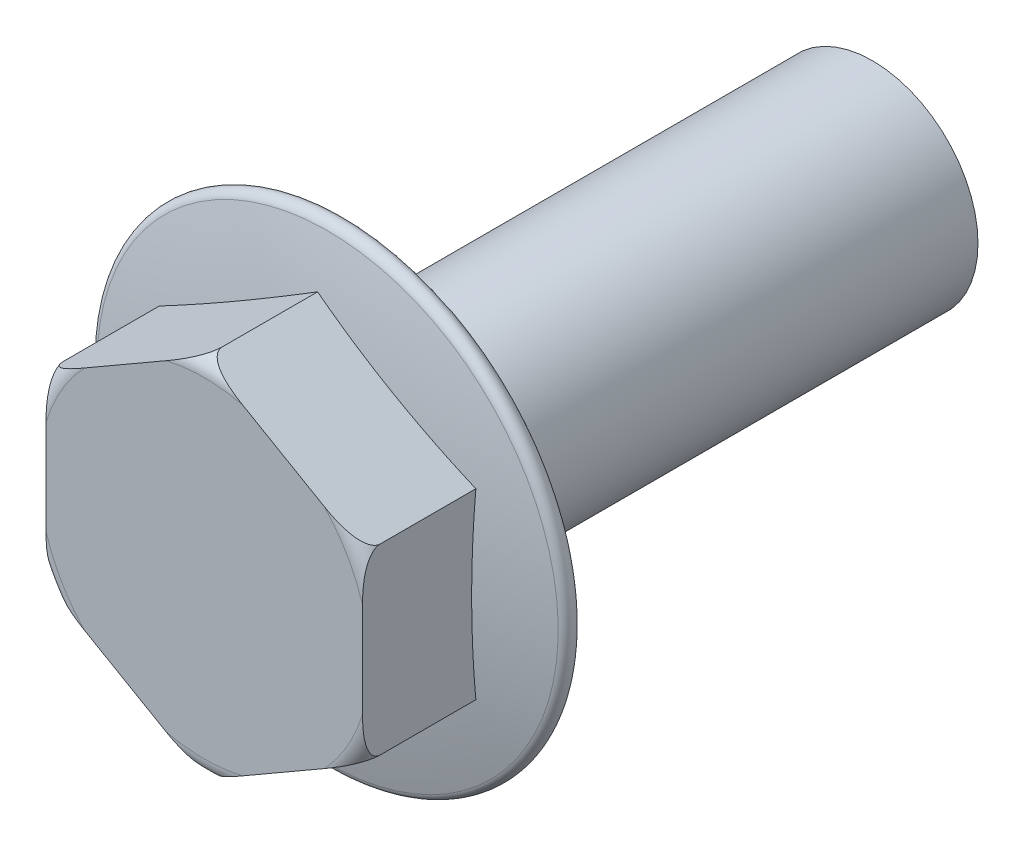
ISO-10303-21;
HEADER;
FILE_DESCRIPTION(('STEP AP214'),'2;1');
FILE_NAME('part.step','',(''),(''),'','','');
FILE_SCHEMA(('AUTOMOTIVE_DESIGN { 1 0 10303 214 1 1 1 1 }'));
ENDSEC;
DATA;
#1=APPLICATION_CONTEXT('core data for automotive mechanical design processes');
#2=APPLICATION_PROTOCOL_DEFINITION('international standard','automotive_design',2000,#1);
#3=PRODUCT_CONTEXT('',#1,'mechanical');
#4=PRODUCT('Part','Part','',(#3));
#5=PRODUCT_RELATED_PRODUCT_CATEGORY('part','',(#4));
#6=PRODUCT_DEFINITION_FORMATION('','',#4);
#7=PRODUCT_DEFINITION_CONTEXT('part definition',#1,'design');
#8=PRODUCT_DEFINITION('design','',#6,#7);
#9=PRODUCT_DEFINITION_SHAPE('','',#8);
#10=(LENGTH_UNIT() NAMED_UNIT(*) SI_UNIT(.MILLI.,.METRE.));
#11=(NAMED_UNIT(*) PLANE_ANGLE_UNIT() SI_UNIT($,.RADIAN.));
#12=(NAMED_UNIT(*) SI_UNIT($,.STERADIAN.) SOLID_ANGLE_UNIT());
#13=UNCERTAINTY_MEASURE_WITH_UNIT(LENGTH_MEASURE(1.E-05),#10,'distance_accuracy_value','');
#14=(GEOMETRIC_REPRESENTATION_CONTEXT(3) GLOBAL_UNCERTAINTY_ASSIGNED_CONTEXT((#13)) GLOBAL_UNIT_ASSIGNED_CONTEXT((#10,
#11,#12)) REPRESENTATION_CONTEXT('',''));
#15=CARTESIAN_POINT('',(0.,0.,0.));
#16=DIRECTION('',(0.,0.,1.));
#17=DIRECTION('',(1.,0.,0.));
#18=AXIS2_PLACEMENT_3D('',#15,#16,#17);
#19=CARTESIAN_POINT('',(-17.9999999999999,0.,0.));
#20=DIRECTION('',(0.,0.,1.));
#21=DIRECTION('',(1.,0.,0.));
#22=AXIS2_PLACEMENT_3D('',#19,#20,#21);
#23=PLANE('',#22);
#24=CARTESIAN_POINT('',(0.,0.,0.));
#25=DIRECTION('',(0.,0.,-1.));
#26=DIRECTION('',(-1.,0.,0.));
#27=AXIS2_PLACEMENT_3D('',#24,#25,#26);
#28=CIRCLE('',#27,13.);
#29=CARTESIAN_POINT('',(-13.,0.,0.));
#30=VERTEX_POINT('',#29);
#31=EDGE_CURVE('E216',#30,#30,#28,.T.);
#32=ORIENTED_EDGE('',*,*,#31,.T.);
#33=EDGE_LOOP('',(#32));
#34=FACE_BOUND('',#33,.T.);
#35=CARTESIAN_POINT('',(0.,0.,0.));
#36=DIRECTION('',(0.,0.,1.));
#37=DIRECTION('',(1.,0.,0.));
#38=AXIS2_PLACEMENT_3D('',#35,#36,#37);
#39=CIRCLE('',#38,6.);
#40=CARTESIAN_POINT('',(6.,0.,0.));
#41=VERTEX_POINT('',#40);
#42=EDGE_CURVE('E11',#41,#41,#39,.F.);
#43=ORIENTED_EDGE('',*,*,#42,.F.);
#44=EDGE_LOOP('',(#43));
#45=FACE_BOUND('',#44,.T.);
#46=ADVANCED_FACE('F35',(#34,#45),#23,.F.);
#47=CARTESIAN_POINT('',(-8.99999999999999,5.19615242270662,8.));
#48=DIRECTION('',(-0.500000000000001,0.866025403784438,0.));
#49=DIRECTION('',(-0.866025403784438,-0.500000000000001,0.));
#50=AXIS2_PLACEMENT_3D('',#47,#48,#49);
#51=PLANE('',#50);
#52=DIRECTION('',(0.,0.,-1.));
#53=VECTOR('',#52,1.);
#54=CARTESIAN_POINT('',(-8.99999999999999,5.19615242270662,8.));
#55=LINE('',#54,#53);
#56=CARTESIAN_POINT('',(-8.99999999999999,5.19615242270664,7.));
#57=VERTEX_POINT('',#56);
#58=CARTESIAN_POINT('',(-8.99999999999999,5.19615242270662,1.5544656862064));
#59=VERTEX_POINT('',#58);
#60=EDGE_CURVE('E159',#57,#59,#55,.T.);
#61=ORIENTED_EDGE('',*,*,#60,.F.);
#62=CARTESIAN_POINT('',(-8.99999996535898,5.19615244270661,6.9998));
#63=CARTESIAN_POINT('',(-9.00007287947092,5.19611034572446,7.029848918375));
#64=CARTESIAN_POINT('',(-8.99767862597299,5.19749266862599,7.05982019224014));
#65=CARTESIAN_POINT('',(-8.98850257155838,5.20279046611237,7.11859397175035));
#66=CARTESIAN_POINT('',(-8.98175951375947,5.20668357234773,7.14740443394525));
#67=CARTESIAN_POINT('',(-8.96444157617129,5.21668208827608,7.20331461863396));
#68=CARTESIAN_POINT('',(-8.9538781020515,5.22278091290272,7.23041915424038));
#69=CARTESIAN_POINT('',(-8.92959708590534,5.2367995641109,7.28271798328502));
#70=CARTESIAN_POINT('',(-8.91587225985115,5.24472359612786,7.30790768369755));
#71=CARTESIAN_POINT('',(-8.87565276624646,5.2679443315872,7.37277634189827));
#72=CARTESIAN_POINT('',(-8.84685473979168,5.284570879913,7.41054770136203));
#73=CARTESIAN_POINT('',(-8.78459083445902,5.32051896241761,7.48054821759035));
#74=CARTESIAN_POINT('',(-8.75111183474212,5.33984807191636,7.51276120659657));
#75=CARTESIAN_POINT('',(-8.68544005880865,5.37776368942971,7.56861879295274));
#76=CARTESIAN_POINT('',(-8.6536025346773,5.39614509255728,7.59283056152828));
#77=CARTESIAN_POINT('',(-8.58823418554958,5.43388552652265,7.63801467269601));
#78=CARTESIAN_POINT('',(-8.55470201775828,5.45324533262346,7.65898439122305));
#79=CARTESIAN_POINT('',(-8.45224102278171,5.51240121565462,7.71771260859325));
#80=CARTESIAN_POINT('',(-8.38150186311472,5.55324248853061,7.75124717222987));
#81=CARTESIAN_POINT('',(-8.21440824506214,5.64971403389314,7.81911493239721));
#82=CARTESIAN_POINT('',(-8.11712022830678,5.70588329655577,7.8502491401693));
#83=CARTESIAN_POINT('',(-7.92033363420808,5.81949808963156,7.90172042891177));
#84=CARTESIAN_POINT('',(-7.82083101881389,5.87694595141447,7.92203575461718));
#85=CARTESIAN_POINT('',(-7.62035493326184,5.99269087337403,7.95462087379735));
#86=CARTESIAN_POINT('',(-7.51937648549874,6.05099080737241,7.96684790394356));
#87=CARTESIAN_POINT('',(-7.31712668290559,6.16775978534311,7.98512017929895));
#88=CARTESIAN_POINT('',(-7.21585569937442,6.22622861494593,7.99117131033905));
#89=CARTESIAN_POINT('',(-7.00542391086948,6.34772146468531,7.99898077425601));
#90=CARTESIAN_POINT('',(-6.89625413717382,6.41075066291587,8.00037396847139));
#91=CARTESIAN_POINT('',(-6.67792056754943,6.53680560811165,7.99946115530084));
#92=CARTESIAN_POINT('',(-6.56875677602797,6.59983135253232,7.9971544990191));
#93=CARTESIAN_POINT('',(-6.35039182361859,6.72590441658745,7.99021146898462));
#94=CARTESIAN_POINT('',(-6.24119071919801,6.78895170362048,7.98557297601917));
#95=CARTESIAN_POINT('',(-6.02282749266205,6.91502377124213,7.9751824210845));
#96=CARTESIAN_POINT('',(-5.91366537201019,6.9780485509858,7.96943032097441));
#97=CARTESIAN_POINT('',(-5.69574393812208,7.10386554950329,7.95791669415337));
#98=CARTESIAN_POINT('',(-5.58698462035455,7.16665777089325,7.95215527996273));
#99=CARTESIAN_POINT('',(-5.36943563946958,7.29225973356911,7.94152756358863));
#100=CARTESIAN_POINT('',(-5.2606459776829,7.3550694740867,7.93666122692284));
#101=CARTESIAN_POINT('',(-5.04308077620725,7.48068080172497,7.92856042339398));
#102=CARTESIAN_POINT('',(-4.93430526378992,7.54348237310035,7.92532502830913));
#103=CARTESIAN_POINT('',(-4.71672313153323,7.6691034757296,7.92095876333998));
#104=CARTESIAN_POINT('',(-4.60791651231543,7.73192300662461,7.91982785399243));
#105=CARTESIAN_POINT('',(-4.37501520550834,7.8663886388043,7.91984376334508));
#106=CARTESIAN_POINT('',(-4.25092044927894,7.93803477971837,7.92133293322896));
#107=CARTESIAN_POINT('',(-4.00275818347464,8.08131133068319,7.926995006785));
#108=CARTESIAN_POINT('',(-3.87869068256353,8.1529417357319,7.93116838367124));
#109=CARTESIAN_POINT('',(-3.63048770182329,8.29624179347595,7.94140237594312));
#110=CARTESIAN_POINT('',(-3.50635228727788,8.36791140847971,7.94746496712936));
#111=CARTESIAN_POINT('',(-3.25811466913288,8.51123146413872,7.96027024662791));
#112=CARTESIAN_POINT('',(-3.13401246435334,8.58288190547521,7.967012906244));
#113=CARTESIAN_POINT('',(-2.84605021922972,8.74913698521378,7.98172571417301));
#114=CARTESIAN_POINT('',(-2.68217823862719,8.84374851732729,7.98939801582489));
#115=CARTESIAN_POINT('',(-2.35416731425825,9.03312571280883,7.99935024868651));
#116=CARTESIAN_POINT('',(-2.19002827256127,9.12789143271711,8.00162716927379));
#117=CARTESIAN_POINT('',(-1.9420352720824,9.27107025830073,7.99726083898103));
#118=CARTESIAN_POINT('',(-1.85813934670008,9.31950759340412,7.99443244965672));
#119=CARTESIAN_POINT('',(-1.69049738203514,9.41629572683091,7.98525843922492));
#120=CARTESIAN_POINT('',(-1.60675131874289,9.46464653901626,7.97891344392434));
#121=CARTESIAN_POINT('',(-1.43969419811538,9.56109701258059,7.96176565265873));
#122=CARTESIAN_POINT('',(-1.35638272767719,9.60919691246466,7.95096844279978));
#123=CARTESIAN_POINT('',(-1.19047014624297,9.70498658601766,7.92373472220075));
#124=CARTESIAN_POINT('',(-1.10786869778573,9.7526765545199,7.90730106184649));
#125=CARTESIAN_POINT('',(-0.944473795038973,9.84701264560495,7.86737450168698));
#126=CARTESIAN_POINT('',(-0.863672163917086,9.89366348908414,7.84392734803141));
#127=CARTESIAN_POINT('',(-0.704335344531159,9.98565664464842,7.78782460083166));
#128=CARTESIAN_POINT('',(-0.625801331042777,10.0309982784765,7.75516432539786));
#129=CARTESIAN_POINT('',(-0.491369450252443,10.1086125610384,7.68681545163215));
#130=CARTESIAN_POINT('',(-0.434513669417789,10.1414382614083,7.65367356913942));
#131=CARTESIAN_POINT('',(-0.32542631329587,10.2044198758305,7.57839869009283));
#132=CARTESIAN_POINT('',(-0.273181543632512,10.2345834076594,7.53629260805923));
#133=CARTESIAN_POINT('',(-0.198501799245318,10.2776997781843,7.4622197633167));
#134=CARTESIAN_POINT('',(-0.173187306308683,10.2923151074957,7.43414444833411));
#135=CARTESIAN_POINT('',(-0.126125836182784,10.3194860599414,7.37420275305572));
#136=CARTESIAN_POINT('',(-0.104376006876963,10.3320433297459,7.34233943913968));
#137=CARTESIAN_POINT('',(-0.0693738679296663,10.3522518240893,7.28093034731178));
#138=CARTESIAN_POINT('',(-0.0552954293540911,10.3603800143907,7.25201856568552));
#139=CARTESIAN_POINT('',(-0.0314467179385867,10.3741490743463,7.19194849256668));
#140=CARTESIAN_POINT('',(-0.0216643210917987,10.3797969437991,7.16079681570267));
#141=CARTESIAN_POINT('',(-0.00972103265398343,10.3866924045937,7.10786758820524));
#142=CARTESIAN_POINT('',(-0.00609809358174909,10.3887841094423,7.08652363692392));
#143=CARTESIAN_POINT('',(-0.00122064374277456,10.3916001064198,7.043395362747));
#144=CARTESIAN_POINT('',(2.4528875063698E-05,10.3923190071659,7.02160964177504));
#145=CARTESIAN_POINT('',(-3.46410141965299E-08,10.3923048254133,6.9998));
#146=B_SPLINE_CURVE_WITH_KNOTS('',3,(#62,#63,#64,#65,#66,#67,#68,#69,#70,#71,#72,#73,#74,#75,
#76,#77,#78,#79,#80,#81,#82,#83,#84,#85,#86,#87,#88,#89,#90,#91,#92,#93,#94,#95,#96,#97,#98,#99,
#100,#101,#102,#103,#104,#105,#106,#107,#108,#109,#110,#111,#112,#113,#114,#115,#116,#117,#118,
#119,#120,#121,#122,#123,#124,#125,#126,#127,#128,#129,#130,#131,#132,#133,#134,#135,#136,#137,
#138,#139,#140,#141,#142,#143,#144,#145),.UNSPECIFIED.,.F.,.F.,(4,2,2,2,2,2,2,2,2,2,2,2,2,2,2,2,
2,2,2,2,2,2,2,2,2,2,2,2,2,2,2,2,2,2,2,2,2,2,2,2,2,4),(0.,0.0898936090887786,0.178997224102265,
0.267836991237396,0.356883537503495,0.506985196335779,0.657516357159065,0.789382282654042,
0.921354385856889,1.18552388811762,1.53449071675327,1.88415664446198,2.23565680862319,
2.58682166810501,2.964939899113,3.34312445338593,3.72165333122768,4.1001951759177,
4.47734447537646,4.85447924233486,5.23139912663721,5.60831194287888,6.03818187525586,
6.4681276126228,6.89852451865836,7.32890327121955,7.89703035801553,8.46547438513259,
8.75617369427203,9.04682128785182,9.3371053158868,9.62724276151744,9.91552756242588,
10.2039591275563,10.4241180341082,10.643625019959,10.7649282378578,10.8861339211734,
10.9852756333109,11.0841357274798,11.1492194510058,11.2145582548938),.UNSPECIFIED.);
#147=CARTESIAN_POINT('',(-6.82627228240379,6.45115470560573,8.));
#148=VERTEX_POINT('',#147);
#149=EDGE_CURVE('E219',#57,#148,#146,.T.);
#150=ORIENTED_EDGE('',*,*,#149,.T.);
#151=DIRECTION('',(0.866025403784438,0.500000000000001,0.));
#152=VECTOR('',#151,1.);
#153=CARTESIAN_POINT('',(-8.99999999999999,5.19615242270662,8.));
#154=LINE('',#153,#152);
#155=CARTESIAN_POINT('',(-2.17372771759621,9.13730256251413,8.));
#156=VERTEX_POINT('',#155);
#157=EDGE_CURVE('E198',#148,#156,#154,.T.);
#158=ORIENTED_EDGE('',*,*,#157,.T.);
#159=CARTESIAN_POINT('',(0.,10.3923048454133,7.));
#160=VERTEX_POINT('',#159);
#161=EDGE_CURVE('E259',#156,#160,#146,.T.);
#162=ORIENTED_EDGE('',*,*,#161,.T.);
#163=DIRECTION('',(0.,0.,-1.));
#164=VECTOR('',#163,1.);
#165=CARTESIAN_POINT('',(0.,10.3923048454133,8.));
#166=LINE('',#165,#164);
#167=CARTESIAN_POINT('',(0.,10.3923048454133,1.5544656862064));
#168=VERTEX_POINT('',#167);
#169=EDGE_CURVE('E148',#160,#168,#166,.T.);
#170=ORIENTED_EDGE('',*,*,#169,.T.);
#171=CARTESIAN_POINT('',(-4.5,7.79422863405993,-55.0833333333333));
#172=DIRECTION('',(-0.500000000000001,0.866025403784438,0.));
#173=DIRECTION('',(-0.866025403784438,-0.500000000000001,0.));
#174=AXIS2_PLACEMENT_3D('',#171,#172,#173);
#175=CIRCLE('',#174,56.8756562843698);
#176=EDGE_CURVE('E200',#168,#59,#175,.F.);
#177=ORIENTED_EDGE('',*,*,#176,.T.);
#178=EDGE_LOOP('',(#61,#150,#158,#162,#170,#177));
#179=FACE_BOUND('',#178,.T.);
#180=ADVANCED_FACE('F283',(#179),#51,.T.);
#181=CARTESIAN_POINT('',(-9.00000000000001,-5.19615242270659,8.));
#182=DIRECTION('',(-1.,0.,0.));
#183=DIRECTION('',(0.,-1.,0.));
#184=AXIS2_PLACEMENT_3D('',#181,#182,#183);
#185=PLANE('',#184);
#186=DIRECTION('',(0.,1.,0.));
#187=VECTOR('',#186,1.);
#188=CARTESIAN_POINT('',(-9.00000000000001,-5.19615242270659,8.));
#189=LINE('',#188,#187);
#190=CARTESIAN_POINT('',(-9.00000000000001,-2.68614785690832,8.));
#191=VERTEX_POINT('',#190);
#192=CARTESIAN_POINT('',(-8.99999999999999,2.68614785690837,8.));
#193=VERTEX_POINT('',#192);
#194=EDGE_CURVE('E152',#191,#193,#189,.T.);
#195=ORIENTED_EDGE('',*,*,#194,.T.);
#196=CARTESIAN_POINT('',(-9.,0.,7.9198352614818));
#197=CARTESIAN_POINT('',(-9.,0.166580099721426,7.91984030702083));
#198=CARTESIAN_POINT('',(-9.,0.333161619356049,7.92185252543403));
#199=CARTESIAN_POINT('',(-9.,0.666252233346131,7.92939674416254));
#200=CARTESIAN_POINT('',(-9.,0.83276131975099,7.93492906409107));
#201=CARTESIAN_POINT('',(-9.,1.1660550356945,7.94809093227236));
#202=CARTESIAN_POINT('',(-9.,1.33283946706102,7.95572506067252));
#203=CARTESIAN_POINT('',(-9.,1.66639804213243,7.97098824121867));
#204=CARTESIAN_POINT('',(-8.99999999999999,1.83317218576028,7.97861729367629));
#205=CARTESIAN_POINT('',(-8.99999999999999,2.14030204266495,7.99030135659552));
#206=CARTESIAN_POINT('',(-8.99999999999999,2.28064204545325,7.99473177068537));
#207=CARTESIAN_POINT('',(-8.99999999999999,2.56138743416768,8.00002492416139));
#208=CARTESIAN_POINT('',(-8.99999999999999,2.70179280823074,8.0008881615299));
#209=CARTESIAN_POINT('',(-8.99999999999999,2.98251450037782,7.99701302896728));
#210=CARTESIAN_POINT('',(-8.99999999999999,3.12283083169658,7.99227599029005));
#211=CARTESIAN_POINT('',(-8.99999999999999,3.40294413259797,7.97472346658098));
#212=CARTESIAN_POINT('',(-8.99999999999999,3.54274139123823,7.96191349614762));
#213=CARTESIAN_POINT('',(-8.99999999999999,3.75185502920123,7.93406741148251));
#214=CARTESIAN_POINT('',(-8.99999999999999,3.82173617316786,7.92328722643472));
#215=CARTESIAN_POINT('',(-8.99999999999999,3.96086676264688,7.89825695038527));
#216=CARTESIAN_POINT('',(-8.99999999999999,4.03011638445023,7.88400786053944));
#217=CARTESIAN_POINT('',(-8.99999999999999,4.16742848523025,7.85140140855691));
#218=CARTESIAN_POINT('',(-8.99999999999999,4.23549399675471,7.83305701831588));
#219=CARTESIAN_POINT('',(-8.99999999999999,4.37005497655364,7.79137190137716));
#220=CARTESIAN_POINT('',(-8.99999999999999,4.43655164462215,7.76803513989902));
#221=CARTESIAN_POINT('',(-8.99999999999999,4.55797807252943,7.71890053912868));
#222=CARTESIAN_POINT('',(-8.99999999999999,4.61322671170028,7.69390100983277));
#223=CARTESIAN_POINT('',(-8.99999999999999,4.72107103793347,7.63831638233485));
#224=CARTESIAN_POINT('',(-8.99999999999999,4.77366016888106,7.60771826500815));
#225=CARTESIAN_POINT('',(-8.99999999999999,4.87510755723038,7.5393190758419));
#226=CARTESIAN_POINT('',(-8.99999999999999,4.92390276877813,7.50142254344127));
#227=CARTESIAN_POINT('',(-8.99999999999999,5.01377509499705,7.41738246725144));
#228=CARTESIAN_POINT('',(-8.99999999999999,5.05489193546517,7.37128392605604));
#229=CARTESIAN_POINT('',(-8.99999999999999,5.10779762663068,7.29438225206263));
#230=CARTESIAN_POINT('',(-8.99999999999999,5.12421961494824,7.26677497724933));
#231=CARTESIAN_POINT('',(-8.99999999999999,5.15260949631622,7.20933487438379));
#232=CARTESIAN_POINT('',(-8.99999999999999,5.16458069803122,7.17950371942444));
#233=CARTESIAN_POINT('',(-8.99999999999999,5.18318325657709,7.11789183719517));
#234=CARTESIAN_POINT('',(-8.99999999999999,5.18976575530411,7.08609602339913));
#235=CARTESIAN_POINT('',(-8.99999999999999,5.19670934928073,7.02183240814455));
#236=CARTESIAN_POINT('',(-8.99999999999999,5.19707460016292,6.98936507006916));
#237=CARTESIAN_POINT('',(-8.99999999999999,5.19186286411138,6.92851943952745));
#238=CARTESIAN_POINT('',(-8.99999999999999,5.18693231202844,6.90008275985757));
#239=CARTESIAN_POINT('',(-8.99999999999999,5.17255081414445,6.8443845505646));
#240=CARTESIAN_POINT('',(-8.99999999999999,5.16309750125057,6.8171236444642));
#241=CARTESIAN_POINT('',(-8.99999999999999,5.13659623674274,6.75561616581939));
#242=CARTESIAN_POINT('',(-8.99999999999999,5.1180747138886,6.72200766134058));
#243=CARTESIAN_POINT('',(-8.99999999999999,5.0758883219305,6.65820441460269));
#244=CARTESIAN_POINT('',(-8.99999999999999,5.0522130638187,6.62801675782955));
#245=CARTESIAN_POINT('',(-8.99999999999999,4.98709372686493,6.5553571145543));
#246=CARTESIAN_POINT('',(-8.99999999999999,4.94303398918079,6.51524894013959));
#247=CARTESIAN_POINT('',(-8.99999999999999,4.8494631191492,6.44204326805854));
#248=CARTESIAN_POINT('',(-8.99999999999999,4.79993792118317,6.40896453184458));
#249=CARTESIAN_POINT('',(-8.99999999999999,4.70078341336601,6.35059710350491));
#250=CARTESIAN_POINT('',(-8.99999999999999,4.65136401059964,6.32494512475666));
#251=CARTESIAN_POINT('',(-8.99999999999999,4.55050656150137,6.27791925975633));
#252=CARTESIAN_POINT('',(-8.99999999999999,4.4990667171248,6.25654929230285));
#253=CARTESIAN_POINT('',(-8.99999999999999,4.39479516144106,6.21741950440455));
#254=CARTESIAN_POINT('',(-8.99999999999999,4.34196221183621,6.19966302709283));
#255=CARTESIAN_POINT('',(-8.99999999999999,4.23538899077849,6.16725269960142));
#256=CARTESIAN_POINT('',(-8.99999999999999,4.18164909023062,6.15259761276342));
#257=CARTESIAN_POINT('',(-8.99999999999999,4.04373916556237,6.11859292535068));
#258=CARTESIAN_POINT('',(-8.99999999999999,3.95911158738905,6.10110354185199));
#259=CARTESIAN_POINT('',(-8.99999999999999,3.78894671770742,6.07121034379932));
#260=CARTESIAN_POINT('',(-8.99999999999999,3.70340893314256,6.0588094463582));
#261=CARTESIAN_POINT('',(-8.99999999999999,3.53169103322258,6.03810951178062));
#262=CARTESIAN_POINT('',(-8.99999999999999,3.44551002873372,6.02981802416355));
#263=CARTESIAN_POINT('',(-8.99999999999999,3.27288512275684,6.01658573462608));
#264=CARTESIAN_POINT('',(-8.99999999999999,3.18644117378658,6.01164557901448));
#265=CARTESIAN_POINT('',(-8.99999999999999,2.92577764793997,6.00080060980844));
#266=CARTESIAN_POINT('',(-8.99999999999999,2.75139430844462,5.9989928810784));
#267=CARTESIAN_POINT('',(-8.99999999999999,2.40289888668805,6.00194314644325));
#268=CARTESIAN_POINT('',(-8.99999999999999,2.22878669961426,6.00669562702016));
#269=CARTESIAN_POINT('',(-8.99999999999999,1.84894626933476,6.02045812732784));
#270=CARTESIAN_POINT('',(-9.,1.64324322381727,6.03008655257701));
#271=CARTESIAN_POINT('',(-9.,1.23180579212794,6.04888078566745));
#272=CARTESIAN_POINT('',(-9.,1.02607140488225,6.05804656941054));
#273=CARTESIAN_POINT('',(-9.,0.614496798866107,6.07222137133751));
#274=CARTESIAN_POINT('',(-9.,0.408656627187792,6.07723157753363));
#275=CARTESIAN_POINT('',(-9.,-0.00305918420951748,6.08115589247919));
#276=CARTESIAN_POINT('',(-9.,-0.208934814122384,6.08007090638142));
#277=CARTESIAN_POINT('',(-9.,-0.620073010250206,6.07223736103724));
#278=CARTESIAN_POINT('',(-9.,-0.825335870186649,6.06550227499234));
#279=CARTESIAN_POINT('',(-9.,-1.23579316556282,6.04899291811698));
#280=CARTESIAN_POINT('',(-9.,-1.44098755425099,6.03921761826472));
#281=CARTESIAN_POINT('',(-9.,-1.85134716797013,6.02072739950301));
#282=CARTESIAN_POINT('',(-9.00000000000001,-2.05651237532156,6.01201208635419));
#283=CARTESIAN_POINT('',(-9.00000000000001,-2.46698468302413,6.00067558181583));
#284=CARTESIAN_POINT('',(-9.00000000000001,-2.67229165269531,5.99805119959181));
#285=CARTESIAN_POINT('',(-9.00000000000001,-2.98101452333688,6.00338665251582));
#286=CARTESIAN_POINT('',(-9.00000000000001,-3.08449560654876,6.00674518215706));
#287=CARTESIAN_POINT('',(-9.00000000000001,-3.29129713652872,6.01761776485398));
#288=CARTESIAN_POINT('',(-9.00000000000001,-3.39461750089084,6.02513350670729));
#289=CARTESIAN_POINT('',(-9.00000000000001,-3.60027093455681,6.04547836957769));
#290=CARTESIAN_POINT('',(-9.00000000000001,-3.7026063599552,6.05828276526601));
#291=CARTESIAN_POINT('',(-9.00000000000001,-3.90616391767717,6.09071222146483));
#292=CARTESIAN_POINT('',(-9.00000000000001,-4.00738686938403,6.1103318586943));
#293=CARTESIAN_POINT('',(-9.00000000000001,-4.17990818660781,6.15177219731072));
#294=CARTESIAN_POINT('',(-9.00000000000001,-4.2517109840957,6.17146885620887));
#295=CARTESIAN_POINT('',(-9.00000000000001,-4.39370831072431,6.21661662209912));
#296=CARTESIAN_POINT('',(-9.00000000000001,-4.46389890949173,6.24208042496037));
#297=CARTESIAN_POINT('',(-9.00000000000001,-4.60187495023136,6.30036617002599));
#298=CARTESIAN_POINT('',(-9.00000000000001,-4.66963655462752,6.33324555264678));
#299=CARTESIAN_POINT('',(-9.00000000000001,-4.79988048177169,6.40813898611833));
#300=CARTESIAN_POINT('',(-9.00000000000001,-4.86238074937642,6.4501200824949));
#301=CARTESIAN_POINT('',(-9.00000000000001,-4.95021956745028,6.52270361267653));
#302=CARTESIAN_POINT('',(-9.00000000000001,-4.97900840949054,6.54911149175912));
#303=CARTESIAN_POINT('',(-9.00000000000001,-5.03304973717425,6.60542398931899));
#304=CARTESIAN_POINT('',(-9.00000000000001,-5.05829994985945,6.63533083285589));
#305=CARTESIAN_POINT('',(-9.00000000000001,-5.10416300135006,6.69918970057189));
#306=CARTESIAN_POINT('',(-9.00000000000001,-5.12470995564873,6.73319007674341));
#307=CARTESIAN_POINT('',(-9.00000000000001,-5.15884294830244,6.80451709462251));
#308=CARTESIAN_POINT('',(-9.00000000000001,-5.17244959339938,6.84183349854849));
#309=CARTESIAN_POINT('',(-9.00000000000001,-5.18844885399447,6.90795173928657));
#310=CARTESIAN_POINT('',(-9.00000000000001,-5.19290069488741,6.93625884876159));
#311=CARTESIAN_POINT('',(-9.00000000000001,-5.19691649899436,6.99321943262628));
#312=CARTESIAN_POINT('',(-9.00000000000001,-5.19648249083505,7.02187275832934));
#313=CARTESIAN_POINT('',(-9.00000000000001,-5.19076672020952,7.07864109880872));
#314=CARTESIAN_POINT('',(-9.00000000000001,-5.18549166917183,7.10675680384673));
#315=CARTESIAN_POINT('',(-9.00000000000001,-5.17054378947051,7.1617869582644));
#316=CARTESIAN_POINT('',(-9.00000000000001,-5.16086794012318,7.18870056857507));
#317=CARTESIAN_POINT('',(-9.00000000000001,-5.13368536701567,7.25008165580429));
#318=CARTESIAN_POINT('',(-9.00000000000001,-5.11461953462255,7.28385611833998));
#319=CARTESIAN_POINT('',(-9.00000000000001,-5.07133180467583,7.3479128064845));
#320=CARTESIAN_POINT('',(-9.00000000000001,-5.04709862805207,7.37818716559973));
#321=CARTESIAN_POINT('',(-9.00000000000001,-4.98033224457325,7.45125391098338));
#322=CARTESIAN_POINT('',(-9.00000000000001,-4.93513749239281,7.49159399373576));
#323=CARTESIAN_POINT('',(-9.00000000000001,-4.83930399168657,7.56509731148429));
#324=CARTESIAN_POINT('',(-9.00000000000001,-4.78865288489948,7.59824371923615));
#325=CARTESIAN_POINT('',(-9.00000000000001,-4.68706266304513,7.65680100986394));
#326=CARTESIAN_POINT('',(-9.00000000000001,-4.63631631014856,7.68255257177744));
#327=CARTESIAN_POINT('',(-9.00000000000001,-4.532801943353,7.72967132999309));
#328=CARTESIAN_POINT('',(-9.00000000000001,-4.4800320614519,7.75103435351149));
#329=CARTESIAN_POINT('',(-9.00000000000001,-4.37306265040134,7.79008607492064));
#330=CARTESIAN_POINT('',(-9.00000000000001,-4.31886078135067,7.80776827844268));
#331=CARTESIAN_POINT('',(-9.00000000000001,-4.2095689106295,7.83995922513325));
#332=CARTESIAN_POINT('',(-9.00000000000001,-4.154479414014,7.85446970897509));
#333=CARTESIAN_POINT('',(-9.00000000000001,-3.99154622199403,7.89317964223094));
#334=CARTESIAN_POINT('',(-9.00000000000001,-3.88281751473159,7.91365596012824));
#335=CARTESIAN_POINT('',(-9.00000000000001,-3.66416890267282,7.94697908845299));
#336=CARTESIAN_POINT('',(-9.00000000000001,-3.55424795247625,7.95981853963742));
#337=CARTESIAN_POINT('',(-9.00000000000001,-3.33356429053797,7.97967660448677));
#338=CARTESIAN_POINT('',(-9.00000000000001,-3.22280003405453,7.98667734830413));
#339=CARTESIAN_POINT('',(-9.00000000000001,-3.00106994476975,7.99621474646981));
#340=CARTESIAN_POINT('',(-9.00000000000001,-2.89010406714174,7.998750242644));
#341=CARTESIAN_POINT('',(-9.00000000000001,-2.66736445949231,8.00052618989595));
#342=CARTESIAN_POINT('',(-9.00000000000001,-2.55559061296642,7.9997430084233));
#343=CARTESIAN_POINT('',(-9.00000000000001,-2.33208022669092,7.99584195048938));
#344=CARTESIAN_POINT('',(-9.00000000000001,-2.22034369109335,7.99272386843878));
#345=CARTESIAN_POINT('',(-9.00000000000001,-1.88559371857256,7.98126369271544));
#346=CARTESIAN_POINT('',(-9.00000000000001,-1.6626604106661,7.97081227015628));
#347=CARTESIAN_POINT('',(-9.,-1.31958192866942,7.95512242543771));
#348=CARTESIAN_POINT('',(-9.,-1.19944099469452,7.94970245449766));
#349=CARTESIAN_POINT('',(-9.,-0.959085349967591,7.93977501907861));
#350=CARTESIAN_POINT('',(-9.,-0.838870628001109,7.93526780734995));
#351=CARTESIAN_POINT('',(-9.,-0.598895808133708,7.92781148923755));
#352=CARTESIAN_POINT('',(-9.,-0.479135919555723,7.92485592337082));
#353=CARTESIAN_POINT('',(-9.,-0.239584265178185,7.92086600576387));
#354=CARTESIAN_POINT('',(-9.,-0.119792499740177,7.9198316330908));
#355=CARTESIAN_POINT('',(-9.,0.,7.9198352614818));
#356=B_SPLINE_CURVE_WITH_KNOTS('',3,(#196,#197,#198,#199,#200,#201,#202,#203,#204,#205,#206,
#207,#208,#209,#210,#211,#212,#213,#214,#215,#216,#217,#218,#219,#220,#221,#222,#223,#224,#225,
#226,#227,#228,#229,#230,#231,#232,#233,#234,#235,#236,#237,#238,#239,#240,#241,#242,#243,#244,
#245,#246,#247,#248,#249,#250,#251,#252,#253,#254,#255,#256,#257,#258,#259,#260,#261,#262,#263,
#264,#265,#266,#267,#268,#269,#270,#271,#272,#273,#274,#275,#276,#277,#278,#279,#280,#281,#282,
#283,#284,#285,#286,#287,#288,#289,#290,#291,#292,#293,#294,#295,#296,#297,#298,#299,#300,#301,
#302,#303,#304,#305,#306,#307,#308,#309,#310,#311,#312,#313,#314,#315,#316,#317,#318,#319,#320,
#321,#322,#323,#324,#325,#326,#327,#328,#329,#330,#331,#332,#333,#334,#335,#336,#337,#338,#339,
#340,#341,#342,#343,#344,#345,#346,#347,#348,#349,#350,#351,#352,#353,#354,#355),.UNSPECIFIED.,
.T.,.F.,(4,2,2,2,2,2,2,2,2,2,2,2,2,2,2,2,2,2,2,2,2,2,2,2,2,2,2,2,2,2,2,2,2,2,2,2,2,2,2,2,2,2,2,
2,2,2,2,2,2,2,2,2,2,2,2,2,2,2,2,2,2,2,2,2,2,2,2,2,2,2,2,2,2,2,2,2,2,2,2,4),(0.,
0.499732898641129,0.999511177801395,1.50038728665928,2.00122911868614,2.42243665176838,
2.84358538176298,3.26463401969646,3.68539535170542,3.89745049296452,4.1094445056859,
4.32077632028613,4.53194090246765,4.71362801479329,4.89574312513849,5.08042554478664,
5.26412425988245,5.36017939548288,5.45616298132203,5.55300747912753,5.64978724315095,
5.73596732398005,5.82219255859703,5.93667218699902,6.05138475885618,6.22912574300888,
6.40733531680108,6.57412873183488,6.74107410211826,6.90817323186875,7.07520560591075,
7.33423774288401,7.59341817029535,7.85307299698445,8.11277788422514,8.63570301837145,
9.15818892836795,9.77596473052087,10.3937726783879,11.0114039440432,11.6289434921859,
12.245014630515,12.8612945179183,13.4773444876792,14.0930716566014,14.4036161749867,
14.7142869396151,15.0235214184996,15.3325103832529,15.555697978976,15.7793817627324,
16.0048616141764,16.2295383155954,16.3464956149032,16.4635276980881,16.5821105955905,
16.7003393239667,16.78591606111,16.8714572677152,16.9568800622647,17.0423615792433,
17.1580617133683,17.2740170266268,17.4547354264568,17.6358721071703,17.8063375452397,
17.9769643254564,18.1478896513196,18.3187209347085,18.6502238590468,18.9820457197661,
19.3148794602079,19.6477995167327,19.9830942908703,20.3184185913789,20.9879291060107,
21.348719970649,21.7096106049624,22.0689866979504,22.4283588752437),.UNSPECIFIED.);
#357=EDGE_CURVE('E226',#193,#57,#356,.T.);
#358=ORIENTED_EDGE('',*,*,#357,.T.);
#359=ORIENTED_EDGE('',*,*,#60,.T.);
#360=CARTESIAN_POINT('',(-9.,0.,-55.0833333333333));
#361=DIRECTION('',(-1.,0.,0.));
#362=DIRECTION('',(0.,-1.,0.));
#363=AXIS2_PLACEMENT_3D('',#360,#361,#362);
#364=CIRCLE('',#363,56.8756562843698);
#365=CARTESIAN_POINT('',(-9.00000000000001,-5.19615242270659,1.5544656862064));
#366=VERTEX_POINT('',#365);
#367=EDGE_CURVE('E203',#59,#366,#364,.F.);
#368=ORIENTED_EDGE('',*,*,#367,.T.);
#369=DIRECTION('',(0.,0.,-1.));
#370=VECTOR('',#369,1.);
#371=CARTESIAN_POINT('',(-9.00000000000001,-5.19615242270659,8.));
#372=LINE('',#371,#370);
#373=CARTESIAN_POINT('',(-9.00000000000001,-5.19615242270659,7.));
#374=VERTEX_POINT('',#373);
#375=EDGE_CURVE('E157',#374,#366,#372,.T.);
#376=ORIENTED_EDGE('',*,*,#375,.F.);
#377=EDGE_CURVE('E220',#374,#191,#356,.T.);
#378=ORIENTED_EDGE('',*,*,#377,.T.);
#379=EDGE_LOOP('',(#195,#358,#359,#368,#376,#378));
#380=FACE_BOUND('',#379,.T.);
#381=ADVANCED_FACE('F37',(#380),#185,.T.);
#382=CARTESIAN_POINT('',(0.,-10.3923048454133,8.));
#383=DIRECTION('',(-0.500000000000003,-0.866025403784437,0.));
#384=DIRECTION('',(0.866025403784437,-0.500000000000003,0.));
#385=AXIS2_PLACEMENT_3D('',#382,#383,#384);
#386=PLANE('',#385);
#387=DIRECTION('',(0.,0.,-1.));
#388=VECTOR('',#387,1.);
#389=CARTESIAN_POINT('',(0.,-10.3923048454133,8.));
#390=LINE('',#389,#388);
#391=CARTESIAN_POINT('',(0.,-10.3923048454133,7.));
#392=VERTEX_POINT('',#391);
#393=CARTESIAN_POINT('',(0.,-10.3923048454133,1.5544656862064));
#394=VERTEX_POINT('',#393);
#395=EDGE_CURVE('E150',#392,#394,#390,.T.);
#396=ORIENTED_EDGE('',*,*,#395,.F.);
#397=CARTESIAN_POINT('',(-3.46410547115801E-08,-10.3923048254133,6.9998));
#398=CARTESIAN_POINT('',(7.28794708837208E-05,-10.3923469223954,7.029848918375));
#399=CARTESIAN_POINT('',(-0.00232137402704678,-10.3909645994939,7.05982019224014));
#400=CARTESIAN_POINT('',(-0.0114974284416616,-10.3856668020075,7.11859397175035));
#401=CARTESIAN_POINT('',(-0.0182404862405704,-10.3817736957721,7.14740443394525));
#402=CARTESIAN_POINT('',(-0.0355584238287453,-10.3717751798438,7.20331461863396));
#403=CARTESIAN_POINT('',(-0.0461218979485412,-10.3656763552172,7.23041915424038));
#404=CARTESIAN_POINT('',(-0.0704029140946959,-10.351657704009,7.28271798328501));
#405=CARTESIAN_POINT('',(-0.0841277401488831,-10.343733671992,7.30790768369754));
#406=CARTESIAN_POINT('',(-0.124347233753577,-10.3205129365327,7.37277634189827));
#407=CARTESIAN_POINT('',(-0.153145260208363,-10.3038863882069,7.41054770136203));
#408=CARTESIAN_POINT('',(-0.215409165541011,-10.2679383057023,7.48054821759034));
#409=CARTESIAN_POINT('',(-0.24888816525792,-10.2486091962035,7.51276120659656));
#410=CARTESIAN_POINT('',(-0.314559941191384,-10.2106935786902,7.56861879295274));
#411=CARTESIAN_POINT('',(-0.346397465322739,-10.1923121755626,7.59283056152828));
#412=CARTESIAN_POINT('',(-0.411765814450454,-10.1545717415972,7.63801467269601));
#413=CARTESIAN_POINT('',(-0.445297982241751,-10.1352119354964,7.65898439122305));
#414=CARTESIAN_POINT('',(-0.547758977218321,-10.0760560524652,7.71771260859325));
#415=CARTESIAN_POINT('',(-0.618498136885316,-10.0352147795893,7.75124717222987));
#416=CARTESIAN_POINT('',(-0.785591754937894,-9.93874323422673,7.81911493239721));
#417=CARTESIAN_POINT('',(-0.882879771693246,-9.8825739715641,7.8502491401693));
#418=CARTESIAN_POINT('',(-1.07966636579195,-9.7689591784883,7.90172042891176));
#419=CARTESIAN_POINT('',(-1.17916898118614,-9.7115113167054,7.92203575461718));
#420=CARTESIAN_POINT('',(-1.37964506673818,-9.59576639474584,7.95462087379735));
#421=CARTESIAN_POINT('',(-1.48062351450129,-9.53746646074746,7.96684790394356));
#422=CARTESIAN_POINT('',(-1.68287331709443,-9.42069748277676,7.98512017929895));
#423=CARTESIAN_POINT('',(-1.7841443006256,-9.36222865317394,7.99117131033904));
#424=CARTESIAN_POINT('',(-1.99457608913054,-9.24073580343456,7.99898077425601));
#425=CARTESIAN_POINT('',(-2.1037458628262,-9.177706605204,8.00037396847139));
#426=CARTESIAN_POINT('',(-2.32207943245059,-9.05165166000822,7.99946115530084));
#427=CARTESIAN_POINT('',(-2.43124322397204,-8.98862591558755,7.99715449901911));
#428=CARTESIAN_POINT('',(-2.64960817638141,-8.86255285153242,7.99021146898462));
#429=CARTESIAN_POINT('',(-2.75880928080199,-8.79950556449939,7.98557297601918));
#430=CARTESIAN_POINT('',(-2.97717250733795,-8.67343349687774,7.97518242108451));
#431=CARTESIAN_POINT('',(-3.08633462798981,-8.61040871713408,7.96943032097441));
#432=CARTESIAN_POINT('',(-3.30425606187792,-8.48459171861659,7.95791669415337));
#433=CARTESIAN_POINT('',(-3.41301537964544,-8.42179949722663,7.95215527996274));
#434=CARTESIAN_POINT('',(-3.63056436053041,-8.29619753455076,7.94152756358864));
#435=CARTESIAN_POINT('',(-3.73935402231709,-8.23338779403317,7.93666122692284));
#436=CARTESIAN_POINT('',(-3.95691922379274,-8.10777646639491,7.92856042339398));
#437=CARTESIAN_POINT('',(-4.06569473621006,-8.04497489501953,7.92532502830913));
#438=CARTESIAN_POINT('',(-4.28327686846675,-7.91935379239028,7.92095876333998));
#439=CARTESIAN_POINT('',(-4.39208348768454,-7.85653426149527,7.91982785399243));
#440=CARTESIAN_POINT('',(-4.62498479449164,-7.72206862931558,7.91984376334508));
#441=CARTESIAN_POINT('',(-4.74907955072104,-7.65042248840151,7.92133293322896));
#442=CARTESIAN_POINT('',(-4.99724181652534,-7.50714593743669,7.926995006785));
#443=CARTESIAN_POINT('',(-5.12130931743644,-7.43551553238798,7.93116838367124));
#444=CARTESIAN_POINT('',(-5.36951229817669,-7.29221547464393,7.94140237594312));
#445=CARTESIAN_POINT('',(-5.4936477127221,-7.22054585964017,7.94746496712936));
#446=CARTESIAN_POINT('',(-5.7418853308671,-7.07722580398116,7.96027024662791));
#447=CARTESIAN_POINT('',(-5.86598753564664,-7.00557536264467,7.967012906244));
#448=CARTESIAN_POINT('',(-6.15394978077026,-6.83932028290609,7.98172571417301));
#449=CARTESIAN_POINT('',(-6.3178217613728,-6.74470875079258,7.98939801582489));
#450=CARTESIAN_POINT('',(-6.64583268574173,-6.55533155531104,7.99935024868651));
#451=CARTESIAN_POINT('',(-6.80997172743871,-6.46056583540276,8.00162716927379));
#452=CARTESIAN_POINT('',(-7.05796472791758,-6.31738700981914,7.99726083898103));
#453=CARTESIAN_POINT('',(-7.1418606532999,-6.26894967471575,7.99443244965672));
#454=CARTESIAN_POINT('',(-7.30950261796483,-6.17216154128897,7.98525843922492));
#455=CARTESIAN_POINT('',(-7.39324868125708,-6.12381072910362,7.97891344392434));
#456=CARTESIAN_POINT('',(-7.56030580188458,-6.02736025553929,7.96176565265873));
#457=CARTESIAN_POINT('',(-7.64361727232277,-5.97926035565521,7.95096844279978));
#458=CARTESIAN_POINT('',(-7.80952985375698,-5.88347068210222,7.92373472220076));
#459=CARTESIAN_POINT('',(-7.89213130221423,-5.83578071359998,7.9073010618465));
#460=CARTESIAN_POINT('',(-8.05552620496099,-5.74144462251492,7.867374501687));
#461=CARTESIAN_POINT('',(-8.13632783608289,-5.69479377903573,7.84392734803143));
#462=CARTESIAN_POINT('',(-8.29566465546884,-5.60280062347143,7.78782460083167));
#463=CARTESIAN_POINT('',(-8.37419866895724,-5.55745898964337,7.75516432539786));
#464=CARTESIAN_POINT('',(-8.50863054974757,-5.4798447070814,7.68681545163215));
#465=CARTESIAN_POINT('',(-8.56548633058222,-5.44701900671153,7.65367356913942));
#466=CARTESIAN_POINT('',(-8.67457368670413,-5.38403739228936,7.57839869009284));
#467=CARTESIAN_POINT('',(-8.72681845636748,-5.35387386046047,7.53629260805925));
#468=CARTESIAN_POINT('',(-8.80149820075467,-5.31075748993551,7.46221976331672));
#469=CARTESIAN_POINT('',(-8.82681269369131,-5.29614216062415,7.43414444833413));
#470=CARTESIAN_POINT('',(-8.87387416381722,-5.2689712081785,7.37420275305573));
#471=CARTESIAN_POINT('',(-8.89562399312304,-5.25641393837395,7.34233943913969));
#472=CARTESIAN_POINT('',(-8.93062613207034,-5.23620544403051,7.28093034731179));
#473=CARTESIAN_POINT('',(-8.94470457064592,-5.22807725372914,7.25201856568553));
#474=CARTESIAN_POINT('',(-8.96855328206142,-5.21430819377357,7.19194849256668));
#475=CARTESIAN_POINT('',(-8.97833567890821,-5.20866032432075,7.16079681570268));
#476=CARTESIAN_POINT('',(-8.99027896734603,-5.20176486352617,7.10786758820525));
#477=CARTESIAN_POINT('',(-8.99390190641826,-5.19967315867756,7.08652363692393));
#478=CARTESIAN_POINT('',(-8.99877935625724,-5.19685716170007,7.04339536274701));
#479=CARTESIAN_POINT('',(-9.00002452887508,-5.19613826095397,7.02160964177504));
#480=CARTESIAN_POINT('',(-8.999999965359,-5.19615244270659,6.9998));
#481=B_SPLINE_CURVE_WITH_KNOTS('',3,(#397,#398,#399,#400,#401,#402,#403,#404,#405,#406,#407,
#408,#409,#410,#411,#412,#413,#414,#415,#416,#417,#418,#419,#420,#421,#422,#423,#424,#425,#426,
#427,#428,#429,#430,#431,#432,#433,#434,#435,#436,#437,#438,#439,#440,#441,#442,#443,#444,#445,
#446,#447,#448,#449,#450,#451,#452,#453,#454,#455,#456,#457,#458,#459,#460,#461,#462,#463,#464,
#465,#466,#467,#468,#469,#470,#471,#472,#473,#474,#475,#476,#477,#478,#479,#480),.UNSPECIFIED.,
.F.,.F.,(4,2,2,2,2,2,2,2,2,2,2,2,2,2,2,2,2,2,2,2,2,2,2,2,2,2,2,2,2,2,2,2,2,2,2,2,2,2,2,2,2,4),
(0.,0.0898936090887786,0.178997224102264,0.267836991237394,0.356883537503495,0.506985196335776,
0.657516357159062,0.78938228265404,0.921354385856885,1.18552388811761,1.53449071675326,
1.88415664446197,2.23565680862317,2.586821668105,2.96493989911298,3.3431244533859,
3.72165333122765,4.10019517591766,4.47734447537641,4.85447924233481,5.23139912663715,
5.60831194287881,6.0381818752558,6.46812761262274,6.8985245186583,7.3289032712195,
7.89703035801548,8.46547438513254,8.75617369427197,9.04682128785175,9.33710531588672,
9.62724276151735,9.91552756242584,10.2039591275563,10.4241180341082,10.6436250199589,
10.7649282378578,10.8861339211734,10.9852756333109,11.0841357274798,11.1492194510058,
11.2145582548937),.UNSPECIFIED.);
#482=CARTESIAN_POINT('',(-2.17372771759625,-9.13730256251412,8.));
#483=VERTEX_POINT('',#482);
#484=EDGE_CURVE('E189',#392,#483,#481,.T.);
#485=ORIENTED_EDGE('',*,*,#484,.T.);
#486=DIRECTION('',(-0.866025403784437,0.500000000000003,0.));
#487=VECTOR('',#486,1.);
#488=CARTESIAN_POINT('',(0.,-10.3923048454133,8.));
#489=LINE('',#488,#487);
#490=CARTESIAN_POINT('',(-6.8262722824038,-6.45115470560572,8.));
#491=VERTEX_POINT('',#490);
#492=EDGE_CURVE('E179',#483,#491,#489,.T.);
#493=ORIENTED_EDGE('',*,*,#492,.T.);
#494=EDGE_CURVE('E187',#491,#374,#481,.T.);
#495=ORIENTED_EDGE('',*,*,#494,.T.);
#496=ORIENTED_EDGE('',*,*,#375,.T.);
#497=CARTESIAN_POINT('',(-4.50000000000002,-7.79422863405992,-55.0833333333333));
#498=DIRECTION('',(-0.500000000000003,-0.866025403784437,0.));
#499=DIRECTION('',(0.866025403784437,-0.500000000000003,0.));
#500=AXIS2_PLACEMENT_3D('',#497,#498,#499);
#501=CIRCLE('',#500,56.8756562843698);
#502=EDGE_CURVE('E206',#366,#394,#501,.F.);
#503=ORIENTED_EDGE('',*,*,#502,.T.);
#504=EDGE_LOOP('',(#396,#485,#493,#495,#496,#503));
#505=FACE_BOUND('',#504,.T.);
#506=ADVANCED_FACE('F186',(#505),#386,.T.);
#507=CARTESIAN_POINT('',(8.99999999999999,-5.19615242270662,8.));
#508=DIRECTION('',(0.499999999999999,-0.866025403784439,0.));
#509=DIRECTION('',(0.866025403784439,0.499999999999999,0.));
#510=AXIS2_PLACEMENT_3D('',#507,#508,#509);
#511=PLANE('',#510);
#512=DIRECTION('',(0.,0.,-1.));
#513=VECTOR('',#512,1.);
#514=CARTESIAN_POINT('',(8.99999999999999,-5.19615242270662,8.));
#515=LINE('',#514,#513);
#516=CARTESIAN_POINT('',(8.99999999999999,-5.19615242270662,7.));
#517=VERTEX_POINT('',#516);
#518=CARTESIAN_POINT('',(8.99999999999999,-5.19615242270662,1.5544656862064));
#519=VERTEX_POINT('',#518);
#520=EDGE_CURVE('E147',#517,#519,#515,.T.);
#521=ORIENTED_EDGE('',*,*,#520,.F.);
#522=CARTESIAN_POINT('',(8.99999996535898,-5.19615244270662,6.9998));
#523=CARTESIAN_POINT('',(9.00007287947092,-5.19611034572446,7.029848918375));
#524=CARTESIAN_POINT('',(8.99767862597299,-5.197492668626,7.05982019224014));
#525=CARTESIAN_POINT('',(8.98850257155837,-5.20279046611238,7.11859397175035));
#526=CARTESIAN_POINT('',(8.98175951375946,-5.20668357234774,7.14740443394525));
#527=CARTESIAN_POINT('',(8.96444157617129,-5.21668208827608,7.20331461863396));
#528=CARTESIAN_POINT('',(8.95387810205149,-5.22278091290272,7.23041915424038));
#529=CARTESIAN_POINT('',(8.92959708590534,-5.2367995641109,7.28271798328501));
#530=CARTESIAN_POINT('',(8.91587225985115,-5.24472359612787,7.30790768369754));
#531=CARTESIAN_POINT('',(8.87565276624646,-5.26794433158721,7.37277634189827));
#532=CARTESIAN_POINT('',(8.84685473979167,-5.28457087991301,7.41054770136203));
#533=CARTESIAN_POINT('',(8.78459083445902,-5.32051896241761,7.48054821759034));
#534=CARTESIAN_POINT('',(8.75111183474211,-5.33984807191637,7.51276120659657));
#535=CARTESIAN_POINT('',(8.68544005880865,-5.37776368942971,7.56861879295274));
#536=CARTESIAN_POINT('',(8.65360253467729,-5.39614509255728,7.59283056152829));
#537=CARTESIAN_POINT('',(8.58823418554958,-5.43388552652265,7.63801467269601));
#538=CARTESIAN_POINT('',(8.55470201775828,-5.45324533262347,7.65898439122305));
#539=CARTESIAN_POINT('',(8.45224102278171,-5.51240121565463,7.71771260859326));
#540=CARTESIAN_POINT('',(8.38150186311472,-5.55324248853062,7.75124717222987));
#541=CARTESIAN_POINT('',(8.21440824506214,-5.64971403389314,7.81911493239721));
#542=CARTESIAN_POINT('',(8.11712022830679,-5.70588329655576,7.8502491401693));
#543=CARTESIAN_POINT('',(7.92033363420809,-5.81949808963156,7.90172042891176));
#544=CARTESIAN_POINT('',(7.8208310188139,-5.87694595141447,7.92203575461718));
#545=CARTESIAN_POINT('',(7.62035493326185,-5.99269087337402,7.95462087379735));
#546=CARTESIAN_POINT('',(7.51937648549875,-6.0509908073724,7.96684790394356));
#547=CARTESIAN_POINT('',(7.31712668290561,-6.1677597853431,7.98512017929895));
#548=CARTESIAN_POINT('',(7.21585569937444,-6.22622861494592,7.99117131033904));
#549=CARTESIAN_POINT('',(7.0054239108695,-6.3477214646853,7.99898077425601));
#550=CARTESIAN_POINT('',(6.89625413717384,-6.41075066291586,8.00037396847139));
#551=CARTESIAN_POINT('',(6.67792056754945,-6.53680560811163,7.99946115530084));
#552=CARTESIAN_POINT('',(6.568756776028,-6.5998313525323,7.99715449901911));
#553=CARTESIAN_POINT('',(6.35039182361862,-6.72590441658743,7.99021146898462));
#554=CARTESIAN_POINT('',(6.24119071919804,-6.78895170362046,7.98557297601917));
#555=CARTESIAN_POINT('',(6.02282749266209,-6.91502377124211,7.97518242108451));
#556=CARTESIAN_POINT('',(5.91366537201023,-6.97804855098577,7.96943032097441));
#557=CARTESIAN_POINT('',(5.69574393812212,-7.10386554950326,7.95791669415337));
#558=CARTESIAN_POINT('',(5.58698462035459,-7.16665777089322,7.95215527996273));
#559=CARTESIAN_POINT('',(5.36943563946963,-7.29225973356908,7.94152756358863));
#560=CARTESIAN_POINT('',(5.26064597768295,-7.35506947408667,7.93666122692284));
#561=CARTESIAN_POINT('',(5.0430807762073,-7.48068080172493,7.92856042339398));
#562=CARTESIAN_POINT('',(4.93430526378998,-7.54348237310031,7.92532502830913));
#563=CARTESIAN_POINT('',(4.71672313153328,-7.66910347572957,7.92095876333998));
#564=CARTESIAN_POINT('',(4.60791651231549,-7.73192300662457,7.91982785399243));
#565=CARTESIAN_POINT('',(4.3750152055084,-7.86638863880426,7.91984376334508));
#566=CARTESIAN_POINT('',(4.25092044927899,-7.93803477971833,7.92133293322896));
#567=CARTESIAN_POINT('',(4.00275818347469,-8.08131133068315,7.92699500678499));
#568=CARTESIAN_POINT('',(3.87869068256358,-8.15294173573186,7.93116838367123));
#569=CARTESIAN_POINT('',(3.63048770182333,-8.29624179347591,7.94140237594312));
#570=CARTESIAN_POINT('',(3.50635228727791,-8.36791140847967,7.94746496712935));
#571=CARTESIAN_POINT('',(3.25811466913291,-8.51123146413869,7.9602702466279));
#572=CARTESIAN_POINT('',(3.13401246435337,-8.58288190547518,7.96701290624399));
#573=CARTESIAN_POINT('',(2.84605021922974,-8.74913698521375,7.98172571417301));
#574=CARTESIAN_POINT('',(2.68217823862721,-8.84374851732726,7.98939801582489));
#575=CARTESIAN_POINT('',(2.35416731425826,-9.03312571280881,7.99935024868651));
#576=CARTESIAN_POINT('',(2.19002827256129,-9.12789143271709,8.00162716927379));
#577=CARTESIAN_POINT('',(1.94203527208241,-9.27107025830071,7.99726083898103));
#578=CARTESIAN_POINT('',(1.85813934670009,-9.3195075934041,7.99443244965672));
#579=CARTESIAN_POINT('',(1.69049738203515,-9.41629572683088,7.98525843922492));
#580=CARTESIAN_POINT('',(1.6067513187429,-9.46464653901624,7.97891344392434));
#581=CARTESIAN_POINT('',(1.4396941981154,-9.56109701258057,7.96176565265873));
#582=CARTESIAN_POINT('',(1.35638272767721,-9.60919691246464,7.95096844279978));
#583=CARTESIAN_POINT('',(1.19047014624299,-9.70498658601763,7.92373472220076));
#584=CARTESIAN_POINT('',(1.10786869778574,-9.75267655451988,7.9073010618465));
#585=CARTESIAN_POINT('',(0.944473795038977,-9.84701264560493,7.86737450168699));
#586=CARTESIAN_POINT('',(0.863672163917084,-9.89366348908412,7.84392734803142));
#587=CARTESIAN_POINT('',(0.704335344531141,-9.98565664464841,7.78782460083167));
#588=CARTESIAN_POINT('',(0.625801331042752,-10.0309982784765,7.75516432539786));
#589=CARTESIAN_POINT('',(0.491369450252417,-10.1086125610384,7.68681545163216));
#590=CARTESIAN_POINT('',(0.434513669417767,-10.1414382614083,7.65367356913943));
#591=CARTESIAN_POINT('',(0.325426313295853,-10.2044198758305,7.57839869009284));
#592=CARTESIAN_POINT('',(0.273181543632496,-10.2345834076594,7.53629260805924));
#593=CARTESIAN_POINT('',(0.198501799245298,-10.2776997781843,7.46221976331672));
#594=CARTESIAN_POINT('',(0.17318730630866,-10.2923151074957,7.43414444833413));
#595=CARTESIAN_POINT('',(0.126125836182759,-10.3194860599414,7.37420275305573));
#596=CARTESIAN_POINT('',(0.104376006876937,-10.3320433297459,7.34233943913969));
#597=CARTESIAN_POINT('',(0.0693738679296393,-10.3522518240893,7.28093034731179));
#598=CARTESIAN_POINT('',(0.055295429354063,-10.3603800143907,7.25201856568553));
#599=CARTESIAN_POINT('',(0.0314467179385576,-10.3741490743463,7.19194849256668));
#600=CARTESIAN_POINT('',(0.0216643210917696,-10.3797969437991,7.16079681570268));
#601=CARTESIAN_POINT('',(0.00972103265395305,-10.3866924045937,7.10786758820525));
#602=CARTESIAN_POINT('',(0.006098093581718,-10.3887841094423,7.08652363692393));
#603=CARTESIAN_POINT('',(0.00122064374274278,-10.3916001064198,7.04339536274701));
#604=CARTESIAN_POINT('',(-2.45288750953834E-05,-10.3923190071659,7.02160964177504));
#605=CARTESIAN_POINT('',(3.46409834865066E-08,-10.3923048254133,6.9998));
#606=B_SPLINE_CURVE_WITH_KNOTS('',3,(#522,#523,#524,#525,#526,#527,#528,#529,#530,#531,#532,
#533,#534,#535,#536,#537,#538,#539,#540,#541,#542,#543,#544,#545,#546,#547,#548,#549,#550,#551,
#552,#553,#554,#555,#556,#557,#558,#559,#560,#561,#562,#563,#564,#565,#566,#567,#568,#569,#570,
#571,#572,#573,#574,#575,#576,#577,#578,#579,#580,#581,#582,#583,#584,#585,#586,#587,#588,#589,
#590,#591,#592,#593,#594,#595,#596,#597,#598,#599,#600,#601,#602,#603,#604,#605),.UNSPECIFIED.,
.F.,.F.,(4,2,2,2,2,2,2,2,2,2,2,2,2,2,2,2,2,2,2,2,2,2,2,2,2,2,2,2,2,2,2,2,2,2,2,2,2,2,2,2,2,4),
(0.,0.0898936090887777,0.178997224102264,0.267836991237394,0.356883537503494,0.506985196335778,
0.657516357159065,0.789382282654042,0.921354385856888,1.18552388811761,1.53449071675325,
1.88415664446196,2.23565680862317,2.58682166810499,2.96493989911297,3.34312445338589,
3.72165333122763,4.10019517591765,4.4773444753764,4.85447924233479,5.23139912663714,
5.6083119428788,6.0381818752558,6.46812761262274,6.89852451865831,7.32890327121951,
7.8970303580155,8.46547438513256,8.756173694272,9.04682128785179,9.33710531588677,
9.62724276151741,9.91552756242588,10.2039591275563,10.4241180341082,10.643625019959,
10.7649282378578,10.8861339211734,10.9852756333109,11.0841357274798,11.1492194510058,
11.2145582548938),.UNSPECIFIED.);
#607=CARTESIAN_POINT('',(6.82627228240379,-6.45115470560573,8.));
#608=VERTEX_POINT('',#607);
#609=EDGE_CURVE('E265',#517,#608,#606,.T.);
#610=ORIENTED_EDGE('',*,*,#609,.T.);
#611=DIRECTION('',(-0.866025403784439,-0.499999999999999,0.));
#612=VECTOR('',#611,1.);
#613=CARTESIAN_POINT('',(8.99999999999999,-5.19615242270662,8.));
#614=LINE('',#613,#612);
#615=CARTESIAN_POINT('',(2.17372771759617,-9.13730256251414,8.));
#616=VERTEX_POINT('',#615);
#617=EDGE_CURVE('E190',#608,#616,#614,.T.);
#618=ORIENTED_EDGE('',*,*,#617,.T.);
#619=EDGE_CURVE('E272',#616,#392,#606,.T.);
#620=ORIENTED_EDGE('',*,*,#619,.T.);
#621=ORIENTED_EDGE('',*,*,#395,.T.);
#622=CARTESIAN_POINT('',(4.49999999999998,-7.79422863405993,-55.0833333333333));
#623=DIRECTION('',(0.499999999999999,-0.866025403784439,0.));
#624=DIRECTION('',(0.866025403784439,0.499999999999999,0.));
#625=AXIS2_PLACEMENT_3D('',#622,#623,#624);
#626=CIRCLE('',#625,56.8756562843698);
#627=EDGE_CURVE('E209',#394,#519,#626,.F.);
#628=ORIENTED_EDGE('',*,*,#627,.T.);
#629=EDGE_LOOP('',(#521,#610,#618,#620,#621,#628));
#630=FACE_BOUND('',#629,.T.);
#631=ADVANCED_FACE('F273',(#630),#511,.T.);
#632=CARTESIAN_POINT('',(9.00000000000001,5.19615242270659,8.));
#633=DIRECTION('',(1.,0.,0.));
#634=DIRECTION('',(0.,1.,0.));
#635=AXIS2_PLACEMENT_3D('',#632,#633,#634);
#636=PLANE('',#635);
#637=DIRECTION('',(0.,-1.,0.));
#638=VECTOR('',#637,1.);
#639=CARTESIAN_POINT('',(9.00000000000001,5.19615242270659,8.));
#640=LINE('',#639,#638);
#641=CARTESIAN_POINT('',(9.00000000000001,2.68614785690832,8.));
#642=VERTEX_POINT('',#641);
#643=CARTESIAN_POINT('',(9.,-2.68614785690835,8.));
#644=VERTEX_POINT('',#643);
#645=EDGE_CURVE('E193',#642,#644,#640,.T.);
#646=ORIENTED_EDGE('',*,*,#645,.T.);
#647=CARTESIAN_POINT('',(9.,0.,7.9198352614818));
#648=CARTESIAN_POINT('',(9.,-0.166580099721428,7.91984030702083));
#649=CARTESIAN_POINT('',(9.,-0.333161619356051,7.92185252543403));
#650=CARTESIAN_POINT('',(9.,-0.666252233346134,7.92939674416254));
#651=CARTESIAN_POINT('',(9.,-0.832761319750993,7.93492906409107));
#652=CARTESIAN_POINT('',(9.,-1.16605503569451,7.94809093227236));
#653=CARTESIAN_POINT('',(9.,-1.33283946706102,7.95572506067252));
#654=CARTESIAN_POINT('',(9.,-1.66639804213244,7.97098824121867));
#655=CARTESIAN_POINT('',(9.,-1.83317218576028,7.97861729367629));
#656=CARTESIAN_POINT('',(9.,-2.14030204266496,7.99030135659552));
#657=CARTESIAN_POINT('',(9.,-2.28064204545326,7.99473177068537));
#658=CARTESIAN_POINT('',(9.,-2.56138743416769,8.00002492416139));
#659=CARTESIAN_POINT('',(9.,-2.70179280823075,8.0008881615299));
#660=CARTESIAN_POINT('',(9.,-2.98251450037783,7.99701302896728));
#661=CARTESIAN_POINT('',(9.,-3.12283083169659,7.99227599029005));
#662=CARTESIAN_POINT('',(9.,-3.40294413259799,7.97472346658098));
#663=CARTESIAN_POINT('',(9.,-3.54274139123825,7.96191349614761));
#664=CARTESIAN_POINT('',(9.,-3.75185502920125,7.93406741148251));
#665=CARTESIAN_POINT('',(9.,-3.82173617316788,7.92328722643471));
#666=CARTESIAN_POINT('',(9.,-3.9608667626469,7.89825695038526));
#667=CARTESIAN_POINT('',(9.,-4.03011638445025,7.88400786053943));
#668=CARTESIAN_POINT('',(9.,-4.16742848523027,7.8514014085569));
#669=CARTESIAN_POINT('',(9.,-4.23549399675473,7.83305701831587));
#670=CARTESIAN_POINT('',(9.,-4.37005497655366,7.79137190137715));
#671=CARTESIAN_POINT('',(9.,-4.43655164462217,7.76803513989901));
#672=CARTESIAN_POINT('',(9.,-4.55797807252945,7.71890053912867));
#673=CARTESIAN_POINT('',(8.99999999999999,-4.6132267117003,7.69390100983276));
#674=CARTESIAN_POINT('',(8.99999999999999,-4.72107103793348,7.63831638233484));
#675=CARTESIAN_POINT('',(8.99999999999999,-4.77366016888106,7.60771826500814));
#676=CARTESIAN_POINT('',(8.99999999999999,-4.87510755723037,7.5393190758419));
#677=CARTESIAN_POINT('',(8.99999999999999,-4.92390276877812,7.50142254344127));
#678=CARTESIAN_POINT('',(8.99999999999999,-5.01377509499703,7.41738246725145));
#679=CARTESIAN_POINT('',(8.99999999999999,-5.05489193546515,7.37128392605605));
#680=CARTESIAN_POINT('',(8.99999999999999,-5.10779762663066,7.29438225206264));
#681=CARTESIAN_POINT('',(8.99999999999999,-5.12421961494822,7.26677497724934));
#682=CARTESIAN_POINT('',(8.99999999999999,-5.15260949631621,7.2093348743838));
#683=CARTESIAN_POINT('',(8.99999999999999,-5.16458069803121,7.17950371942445));
#684=CARTESIAN_POINT('',(8.99999999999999,-5.18318325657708,7.11789183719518));
#685=CARTESIAN_POINT('',(8.99999999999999,-5.1897657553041,7.08609602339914));
#686=CARTESIAN_POINT('',(8.99999999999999,-5.19670934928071,7.02183240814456));
#687=CARTESIAN_POINT('',(8.99999999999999,-5.1970746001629,6.98936507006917));
#688=CARTESIAN_POINT('',(8.99999999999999,-5.19186286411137,6.92851943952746));
#689=CARTESIAN_POINT('',(8.99999999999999,-5.18693231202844,6.90008275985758));
#690=CARTESIAN_POINT('',(8.99999999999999,-5.17255081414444,6.84438455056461));
#691=CARTESIAN_POINT('',(8.99999999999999,-5.16309750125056,6.81712364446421));
#692=CARTESIAN_POINT('',(8.99999999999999,-5.13659623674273,6.7556161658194));
#693=CARTESIAN_POINT('',(8.99999999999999,-5.11807471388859,6.72200766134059));
#694=CARTESIAN_POINT('',(8.99999999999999,-5.07588832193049,6.65820441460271));
#695=CARTESIAN_POINT('',(8.99999999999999,-5.0522130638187,6.62801675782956));
#696=CARTESIAN_POINT('',(8.99999999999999,-4.98709372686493,6.55535711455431));
#697=CARTESIAN_POINT('',(8.99999999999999,-4.94303398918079,6.5152489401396));
#698=CARTESIAN_POINT('',(8.99999999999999,-4.84946311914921,6.44204326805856));
#699=CARTESIAN_POINT('',(8.99999999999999,-4.79993792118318,6.40896453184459));
#700=CARTESIAN_POINT('',(8.99999999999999,-4.70078341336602,6.35059710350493));
#701=CARTESIAN_POINT('',(9.,-4.65136401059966,6.32494512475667));
#702=CARTESIAN_POINT('',(9.,-4.55050656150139,6.27791925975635));
#703=CARTESIAN_POINT('',(9.,-4.49906671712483,6.25654929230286));
#704=CARTESIAN_POINT('',(9.,-4.39479516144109,6.21741950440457));
#705=CARTESIAN_POINT('',(9.,-4.34196221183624,6.19966302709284));
#706=CARTESIAN_POINT('',(9.,-4.23538899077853,6.16725269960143));
#707=CARTESIAN_POINT('',(9.,-4.18164909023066,6.15259761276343));
#708=CARTESIAN_POINT('',(9.,-4.04373916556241,6.11859292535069));
#709=CARTESIAN_POINT('',(9.,-3.95911158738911,6.101103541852));
#710=CARTESIAN_POINT('',(9.,-3.78894671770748,6.07121034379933));
#711=CARTESIAN_POINT('',(9.,-3.70340893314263,6.05880944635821));
#712=CARTESIAN_POINT('',(9.,-3.53169103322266,6.03810951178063));
#713=CARTESIAN_POINT('',(9.,-3.44551002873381,6.02981802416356));
#714=CARTESIAN_POINT('',(9.,-3.27288512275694,6.01658573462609));
#715=CARTESIAN_POINT('',(9.,-3.18644117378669,6.01164557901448));
#716=CARTESIAN_POINT('',(9.,-2.9257776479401,6.00080060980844));
#717=CARTESIAN_POINT('',(9.,-2.75139430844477,5.9989928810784));
#718=CARTESIAN_POINT('',(9.,-2.40289888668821,6.00194314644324));
#719=CARTESIAN_POINT('',(9.,-2.22878669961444,6.00669562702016));
#720=CARTESIAN_POINT('',(9.,-1.84894626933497,6.02045812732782));
#721=CARTESIAN_POINT('',(9.,-1.64324322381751,6.030086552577));
#722=CARTESIAN_POINT('',(9.,-1.23180579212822,6.04888078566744));
#723=CARTESIAN_POINT('',(9.,-1.02607140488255,6.05804656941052));
#724=CARTESIAN_POINT('',(9.,-0.614496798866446,6.0722213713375));
#725=CARTESIAN_POINT('',(9.,-0.408656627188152,6.07723157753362));
#726=CARTESIAN_POINT('',(9.,0.00305918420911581,6.08115589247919));
#727=CARTESIAN_POINT('',(9.,0.208934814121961,6.08007090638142));
#728=CARTESIAN_POINT('',(9.,0.62007301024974,6.07223736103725));
#729=CARTESIAN_POINT('',(9.,0.825335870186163,6.06550227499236));
#730=CARTESIAN_POINT('',(9.,1.23579316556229,6.048992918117));
#731=CARTESIAN_POINT('',(9.00000000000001,1.44098755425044,6.03921761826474));
#732=CARTESIAN_POINT('',(9.00000000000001,1.85134716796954,6.02072739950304));
#733=CARTESIAN_POINT('',(9.00000000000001,2.05651237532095,6.01201208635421));
#734=CARTESIAN_POINT('',(9.00000000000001,2.46698468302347,6.00067558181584));
#735=CARTESIAN_POINT('',(9.00000000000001,2.67229165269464,5.99805119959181));
#736=CARTESIAN_POINT('',(9.00000000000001,2.98101452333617,6.0033866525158));
#737=CARTESIAN_POINT('',(9.00000000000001,3.08449560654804,6.00674518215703));
#738=CARTESIAN_POINT('',(9.00000000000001,3.29129713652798,6.01761776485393));
#739=CARTESIAN_POINT('',(9.00000000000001,3.39461750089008,6.02513350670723));
#740=CARTESIAN_POINT('',(9.00000000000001,3.60027093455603,6.0454783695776));
#741=CARTESIAN_POINT('',(9.00000000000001,3.70260635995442,6.05828276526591));
#742=CARTESIAN_POINT('',(9.00000000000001,3.90616391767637,6.09071222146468));
#743=CARTESIAN_POINT('',(9.00000000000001,4.00738686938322,6.11033185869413));
#744=CARTESIAN_POINT('',(9.00000000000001,4.17990818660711,6.15177219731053));
#745=CARTESIAN_POINT('',(9.00000000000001,4.25171098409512,6.1714688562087));
#746=CARTESIAN_POINT('',(9.00000000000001,4.39370831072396,6.21661662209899));
#747=CARTESIAN_POINT('',(9.00000000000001,4.46389890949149,6.24208042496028));
#748=CARTESIAN_POINT('',(9.00000000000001,4.60187495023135,6.30036617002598));
#749=CARTESIAN_POINT('',(9.00000000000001,4.66963655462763,6.33324555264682));
#750=CARTESIAN_POINT('',(9.00000000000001,4.79988048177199,6.40813898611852));
#751=CARTESIAN_POINT('',(9.00000000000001,4.86238074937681,6.45012008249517));
#752=CARTESIAN_POINT('',(9.00000000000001,4.95021956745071,6.52270361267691));
#753=CARTESIAN_POINT('',(9.00000000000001,4.97900840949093,6.5491114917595));
#754=CARTESIAN_POINT('',(9.00000000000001,5.03304973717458,6.60542398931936));
#755=CARTESIAN_POINT('',(9.00000000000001,5.05829994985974,6.63533083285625));
#756=CARTESIAN_POINT('',(9.00000000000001,5.10416300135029,6.69918970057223));
#757=CARTESIAN_POINT('',(9.00000000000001,5.12470995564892,6.73319007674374));
#758=CARTESIAN_POINT('',(9.00000000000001,5.15884294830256,6.80451709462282));
#759=CARTESIAN_POINT('',(9.00000000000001,5.17244959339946,6.84183349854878));
#760=CARTESIAN_POINT('',(9.00000000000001,5.18844885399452,6.90795173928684));
#761=CARTESIAN_POINT('',(9.00000000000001,5.19290069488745,6.93625884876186));
#762=CARTESIAN_POINT('',(9.00000000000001,5.19691649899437,6.99321943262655));
#763=CARTESIAN_POINT('',(9.00000000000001,5.19648249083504,7.02187275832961));
#764=CARTESIAN_POINT('',(9.00000000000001,5.19076672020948,7.07864109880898));
#765=CARTESIAN_POINT('',(9.00000000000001,5.18549166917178,7.10675680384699));
#766=CARTESIAN_POINT('',(9.00000000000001,5.17054378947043,7.16178695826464));
#767=CARTESIAN_POINT('',(9.00000000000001,5.16086794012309,7.18870056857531));
#768=CARTESIAN_POINT('',(9.00000000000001,5.13368536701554,7.25008165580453));
#769=CARTESIAN_POINT('',(9.00000000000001,5.1146195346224,7.28385611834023));
#770=CARTESIAN_POINT('',(9.00000000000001,5.07133180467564,7.34791280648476));
#771=CARTESIAN_POINT('',(9.00000000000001,5.04709862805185,7.3781871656));
#772=CARTESIAN_POINT('',(9.00000000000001,4.98033224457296,7.45125391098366));
#773=CARTESIAN_POINT('',(9.00000000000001,4.93513749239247,7.49159399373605));
#774=CARTESIAN_POINT('',(9.00000000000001,4.83930399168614,7.56509731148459));
#775=CARTESIAN_POINT('',(9.00000000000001,4.78865288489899,7.59824371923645));
#776=CARTESIAN_POINT('',(9.00000000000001,4.68706266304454,7.65680100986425));
#777=CARTESIAN_POINT('',(9.00000000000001,4.63631631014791,7.68255257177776));
#778=CARTESIAN_POINT('',(9.00000000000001,4.53280194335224,7.72967132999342));
#779=CARTESIAN_POINT('',(9.00000000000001,4.48003206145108,7.75103435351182));
#780=CARTESIAN_POINT('',(9.00000000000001,4.3730626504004,7.79008607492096));
#781=CARTESIAN_POINT('',(9.00000000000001,4.31886078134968,7.807768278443));
#782=CARTESIAN_POINT('',(9.00000000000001,4.20956891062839,7.83995922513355));
#783=CARTESIAN_POINT('',(9.00000000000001,4.15447941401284,7.85446970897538));
#784=CARTESIAN_POINT('',(9.00000000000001,3.99154622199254,7.89317964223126));
#785=CARTESIAN_POINT('',(9.00000000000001,3.88281751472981,7.91365596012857));
#786=CARTESIAN_POINT('',(9.00000000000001,3.66416890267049,7.9469790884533));
#787=CARTESIAN_POINT('',(9.00000000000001,3.55424795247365,7.95981853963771));
#788=CARTESIAN_POINT('',(9.00000000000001,3.3335642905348,7.979676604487));
#789=CARTESIAN_POINT('',(9.00000000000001,3.22280003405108,7.98667734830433));
#790=CARTESIAN_POINT('',(9.00000000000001,3.00106994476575,7.99621474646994));
#791=CARTESIAN_POINT('',(9.00000000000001,2.89010406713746,7.99875024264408));
#792=CARTESIAN_POINT('',(9.00000000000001,2.66736445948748,8.00052618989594));
#793=CARTESIAN_POINT('',(9.00000000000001,2.55559061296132,7.99974300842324));
#794=CARTESIAN_POINT('',(9.00000000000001,2.33208022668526,7.99584195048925));
#795=CARTESIAN_POINT('',(9.00000000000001,2.22034369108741,7.9927238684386));
#796=CARTESIAN_POINT('',(9.00000000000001,1.88559371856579,7.98126369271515));
#797=CARTESIAN_POINT('',(9.00000000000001,1.66266041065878,7.97081227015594));
#798=CARTESIAN_POINT('',(9.00000000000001,1.31958192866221,7.95512242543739));
#799=CARTESIAN_POINT('',(9.,1.19944099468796,7.94970245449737));
#800=CARTESIAN_POINT('',(9.,0.95908534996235,7.93977501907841));
#801=CARTESIAN_POINT('',(9.,0.838870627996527,7.93526780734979));
#802=CARTESIAN_POINT('',(9.,0.598895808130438,7.92781148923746));
#803=CARTESIAN_POINT('',(9.,0.479135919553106,7.92485592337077));
#804=CARTESIAN_POINT('',(9.,0.239584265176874,7.92086600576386));
#805=CARTESIAN_POINT('',(9.,0.119792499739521,7.9198316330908));
#806=CARTESIAN_POINT('',(9.,0.,7.9198352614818));
#807=B_SPLINE_CURVE_WITH_KNOTS('',3,(#647,#648,#649,#650,#651,#652,#653,#654,#655,#656,#657,
#658,#659,#660,#661,#662,#663,#664,#665,#666,#667,#668,#669,#670,#671,#672,#673,#674,#675,#676,
#677,#678,#679,#680,#681,#682,#683,#684,#685,#686,#687,#688,#689,#690,#691,#692,#693,#694,#695,
#696,#697,#698,#699,#700,#701,#702,#703,#704,#705,#706,#707,#708,#709,#710,#711,#712,#713,#714,
#715,#716,#717,#718,#719,#720,#721,#722,#723,#724,#725,#726,#727,#728,#729,#730,#731,#732,#733,
#734,#735,#736,#737,#738,#739,#740,#741,#742,#743,#744,#745,#746,#747,#748,#749,#750,#751,#752,
#753,#754,#755,#756,#757,#758,#759,#760,#761,#762,#763,#764,#765,#766,#767,#768,#769,#770,#771,
#772,#773,#774,#775,#776,#777,#778,#779,#780,#781,#782,#783,#784,#785,#786,#787,#788,#789,#790,
#791,#792,#793,#794,#795,#796,#797,#798,#799,#800,#801,#802,#803,#804,#805,#806),.UNSPECIFIED.,
.T.,.F.,(4,2,2,2,2,2,2,2,2,2,2,2,2,2,2,2,2,2,2,2,2,2,2,2,2,2,2,2,2,2,2,2,2,2,2,2,2,2,2,2,2,2,2,
2,2,2,2,2,2,2,2,2,2,2,2,2,2,2,2,2,2,2,2,2,2,2,2,2,2,2,2,2,2,2,2,2,2,2,2,4),(0.,
0.499732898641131,0.999511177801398,1.50038728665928,2.00122911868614,2.42243665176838,
2.84358538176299,3.26463401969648,3.68539535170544,3.89745049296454,4.10944450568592,
4.32077632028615,4.53194090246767,4.7136280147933,4.89574312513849,5.08042554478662,
5.26412425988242,5.36017939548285,5.456162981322,5.5530074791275,5.64978724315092,
5.73596732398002,5.82219255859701,5.936672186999,6.05138475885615,6.22912574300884,
6.40733531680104,6.57412873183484,6.7410741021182,6.90817323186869,7.07520560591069,
7.33423774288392,7.59341817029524,7.85307299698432,8.11277788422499,8.63570301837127,
9.15818892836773,9.77596473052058,10.3937726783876,11.0114039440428,11.6289434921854,
12.2450146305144,12.8612945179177,13.4773444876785,14.0930716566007,14.4036161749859,
14.7142869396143,15.0235214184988,15.332510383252,15.5556979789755,15.7793817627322,
16.0048616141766,16.229538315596,16.3464956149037,16.4635276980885,16.5821105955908,
16.700339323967,16.7859160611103,16.8714572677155,16.9568800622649,17.0423615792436,
17.1580617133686,17.2740170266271,17.4547354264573,17.6358721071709,17.8063375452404,
17.9769643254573,18.1478896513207,18.3187209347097,18.6502238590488,18.982045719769,
19.3148794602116,19.6477995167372,19.9830942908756,20.3184185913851,20.9879291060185,
21.3487199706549,21.7096106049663,22.0689866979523,22.4283588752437),.UNSPECIFIED.);
#808=EDGE_CURVE('E59',#644,#517,#807,.T.);
#809=ORIENTED_EDGE('',*,*,#808,.T.);
#810=ORIENTED_EDGE('',*,*,#520,.T.);
#811=CARTESIAN_POINT('',(9.,0.,-55.0833333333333));
#812=DIRECTION('',(1.,0.,0.));
#813=DIRECTION('',(0.,1.,0.));
#814=AXIS2_PLACEMENT_3D('',#811,#812,#813);
#815=CIRCLE('',#814,56.8756562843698);
#816=CARTESIAN_POINT('',(9.00000000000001,5.19615242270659,1.5544656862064));
#817=VERTEX_POINT('',#816);
#818=EDGE_CURVE('E146',#519,#817,#815,.F.);
#819=ORIENTED_EDGE('',*,*,#818,.T.);
#820=DIRECTION('',(0.,0.,-1.));
#821=VECTOR('',#820,1.);
#822=CARTESIAN_POINT('',(9.00000000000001,5.19615242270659,8.));
#823=LINE('',#822,#821);
#824=CARTESIAN_POINT('',(9.00000000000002,5.19615242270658,7.));
#825=VERTEX_POINT('',#824);
#826=EDGE_CURVE('E137',#825,#817,#823,.T.);
#827=ORIENTED_EDGE('',*,*,#826,.F.);
#828=EDGE_CURVE('E123',#825,#642,#807,.T.);
#829=ORIENTED_EDGE('',*,*,#828,.T.);
#830=EDGE_LOOP('',(#646,#809,#810,#819,#827,#829));
#831=FACE_BOUND('',#830,.T.);
#832=ADVANCED_FACE('F144',(#831),#636,.T.);
#833=CARTESIAN_POINT('',(0.,10.3923048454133,8.));
#834=DIRECTION('',(0.500000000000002,0.866025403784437,0.));
#835=DIRECTION('',(-0.866025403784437,0.500000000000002,0.));
#836=AXIS2_PLACEMENT_3D('',#833,#834,#835);
#837=PLANE('',#836);
#838=ORIENTED_EDGE('',*,*,#169,.F.);
#839=CARTESIAN_POINT('',(3.46410222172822E-08,10.3923048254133,6.9998));
#840=CARTESIAN_POINT('',(-7.28794709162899E-05,10.3923469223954,7.029848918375));
#841=CARTESIAN_POINT('',(0.00232137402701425,10.3909645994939,7.05982019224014));
#842=CARTESIAN_POINT('',(0.0114974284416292,10.3856668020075,7.11859397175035));
#843=CARTESIAN_POINT('',(0.0182404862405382,10.3817736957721,7.14740443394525));
#844=CARTESIAN_POINT('',(0.0355584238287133,10.3717751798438,7.20331461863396));
#845=CARTESIAN_POINT('',(0.0461218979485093,10.3656763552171,7.23041915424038));
#846=CARTESIAN_POINT('',(0.0704029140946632,10.351657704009,7.28271798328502));
#847=CARTESIAN_POINT('',(0.0841277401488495,10.343733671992,7.30790768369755));
#848=CARTESIAN_POINT('',(0.124347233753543,10.3205129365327,7.37277634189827));
#849=CARTESIAN_POINT('',(0.153145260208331,10.3038863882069,7.41054770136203));
#850=CARTESIAN_POINT('',(0.215409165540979,10.2679383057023,7.48054821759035));
#851=CARTESIAN_POINT('',(0.248888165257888,10.2486091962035,7.51276120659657));
#852=CARTESIAN_POINT('',(0.314559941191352,10.2106935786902,7.56861879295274));
#853=CARTESIAN_POINT('',(0.346397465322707,10.1923121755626,7.59283056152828));
#854=CARTESIAN_POINT('',(0.411765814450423,10.1545717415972,7.63801467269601));
#855=CARTESIAN_POINT('',(0.445297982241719,10.1352119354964,7.65898439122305));
#856=CARTESIAN_POINT('',(0.547758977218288,10.0760560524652,7.71771260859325));
#857=CARTESIAN_POINT('',(0.618498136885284,10.0352147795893,7.75124717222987));
#858=CARTESIAN_POINT('',(0.785591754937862,9.93874323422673,7.81911493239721));
#859=CARTESIAN_POINT('',(0.882879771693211,9.8825739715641,7.8502491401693));
#860=CARTESIAN_POINT('',(1.07966636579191,9.76895917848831,7.90172042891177));
#861=CARTESIAN_POINT('',(1.1791689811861,9.7115113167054,7.92203575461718));
#862=CARTESIAN_POINT('',(1.37964506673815,9.59576639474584,7.95462087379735));
#863=CARTESIAN_POINT('',(1.48062351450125,9.53746646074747,7.96684790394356));
#864=CARTESIAN_POINT('',(1.68287331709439,9.42069748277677,7.98512017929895));
#865=CARTESIAN_POINT('',(1.78414430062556,9.36222865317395,7.99117131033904));
#866=CARTESIAN_POINT('',(1.9945760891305,9.24073580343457,7.99898077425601));
#867=CARTESIAN_POINT('',(2.10374586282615,9.17770660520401,8.00037396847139));
#868=CARTESIAN_POINT('',(2.32207943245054,9.05165166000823,7.99946115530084));
#869=CARTESIAN_POINT('',(2.43124322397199,8.98862591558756,7.99715449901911));
#870=CARTESIAN_POINT('',(2.64960817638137,8.86255285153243,7.99021146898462));
#871=CARTESIAN_POINT('',(2.75880928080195,8.79950556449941,7.98557297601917));
#872=CARTESIAN_POINT('',(2.9771725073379,8.67343349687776,7.97518242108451));
#873=CARTESIAN_POINT('',(3.08633462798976,8.6104087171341,7.96943032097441));
#874=CARTESIAN_POINT('',(3.30425606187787,8.48459171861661,7.95791669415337));
#875=CARTESIAN_POINT('',(3.41301537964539,8.42179949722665,7.95215527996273));
#876=CARTESIAN_POINT('',(3.63056436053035,8.29619753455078,7.94152756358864));
#877=CARTESIAN_POINT('',(3.73935402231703,8.23338779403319,7.93666122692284));
#878=CARTESIAN_POINT('',(3.95691922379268,8.10777646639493,7.92856042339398));
#879=CARTESIAN_POINT('',(4.06569473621,8.04497489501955,7.92532502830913));
#880=CARTESIAN_POINT('',(4.28327686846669,7.9193537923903,7.92095876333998));
#881=CARTESIAN_POINT('',(4.39208348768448,7.85653426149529,7.91982785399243));
#882=CARTESIAN_POINT('',(4.62498479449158,7.7220686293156,7.91984376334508));
#883=CARTESIAN_POINT('',(4.74907955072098,7.65042248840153,7.92133293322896));
#884=CARTESIAN_POINT('',(4.99724181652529,7.50714593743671,7.92699500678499));
#885=CARTESIAN_POINT('',(5.1213093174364,7.435515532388,7.93116838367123));
#886=CARTESIAN_POINT('',(5.36951229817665,7.29221547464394,7.94140237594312));
#887=CARTESIAN_POINT('',(5.49364771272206,7.22054585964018,7.94746496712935));
#888=CARTESIAN_POINT('',(5.74188533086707,7.07722580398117,7.9602702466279));
#889=CARTESIAN_POINT('',(5.86598753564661,7.00557536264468,7.96701290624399));
#890=CARTESIAN_POINT('',(6.15394978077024,6.8393202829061,7.98172571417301));
#891=CARTESIAN_POINT('',(6.31782176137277,6.74470875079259,7.98939801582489));
#892=CARTESIAN_POINT('',(6.64583268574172,6.55533155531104,7.99935024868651));
#893=CARTESIAN_POINT('',(6.80997172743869,6.46056583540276,8.00162716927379));
#894=CARTESIAN_POINT('',(7.05796472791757,6.31738700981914,7.99726083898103));
#895=CARTESIAN_POINT('',(7.14186065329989,6.26894967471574,7.99443244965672));
#896=CARTESIAN_POINT('',(7.30950261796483,6.17216154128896,7.98525843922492));
#897=CARTESIAN_POINT('',(7.39324868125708,6.12381072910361,7.97891344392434));
#898=CARTESIAN_POINT('',(7.56030580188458,6.02736025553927,7.96176565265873));
#899=CARTESIAN_POINT('',(7.64361727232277,5.9792603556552,7.95096844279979));
#900=CARTESIAN_POINT('',(7.80952985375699,5.88347068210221,7.92373472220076));
#901=CARTESIAN_POINT('',(7.89213130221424,5.83578071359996,7.9073010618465));
#902=CARTESIAN_POINT('',(8.05552620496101,5.74144462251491,7.86737450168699));
#903=CARTESIAN_POINT('',(8.1363278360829,5.69479377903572,7.84392734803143));
#904=CARTESIAN_POINT('',(8.29566465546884,5.60280062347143,7.78782460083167));
#905=CARTESIAN_POINT('',(8.37419866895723,5.55745898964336,7.75516432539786));
#906=CARTESIAN_POINT('',(8.50863054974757,5.47984470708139,7.68681545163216));
#907=CARTESIAN_POINT('',(8.56548633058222,5.44701900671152,7.65367356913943));
#908=CARTESIAN_POINT('',(8.67457368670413,5.38403739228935,7.57839869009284));
#909=CARTESIAN_POINT('',(8.72681845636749,5.35387386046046,7.53629260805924));
#910=CARTESIAN_POINT('',(8.80149820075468,5.3107574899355,7.46221976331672));
#911=CARTESIAN_POINT('',(8.82681269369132,5.29614216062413,7.43414444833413));
#912=CARTESIAN_POINT('',(8.87387416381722,5.26897120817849,7.37420275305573));
#913=CARTESIAN_POINT('',(8.89562399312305,5.25641393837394,7.34233943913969));
#914=CARTESIAN_POINT('',(8.93062613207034,5.2362054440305,7.28093034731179));
#915=CARTESIAN_POINT('',(8.94470457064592,5.22807725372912,7.25201856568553));
#916=CARTESIAN_POINT('',(8.96855328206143,5.21430819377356,7.19194849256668));
#917=CARTESIAN_POINT('',(8.97833567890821,5.20866032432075,7.16079681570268));
#918=CARTESIAN_POINT('',(8.99027896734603,5.20176486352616,7.10786758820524));
#919=CARTESIAN_POINT('',(8.99390190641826,5.19967315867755,7.08652363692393));
#920=CARTESIAN_POINT('',(8.99877935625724,5.19685716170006,7.043395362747));
#921=CARTESIAN_POINT('',(9.00002452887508,5.19613826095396,7.02160964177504));
#922=CARTESIAN_POINT('',(8.999999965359,5.19615244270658,6.9998));
#923=B_SPLINE_CURVE_WITH_KNOTS('',3,(#839,#840,#841,#842,#843,#844,#845,#846,#847,#848,#849,
#850,#851,#852,#853,#854,#855,#856,#857,#858,#859,#860,#861,#862,#863,#864,#865,#866,#867,#868,
#869,#870,#871,#872,#873,#874,#875,#876,#877,#878,#879,#880,#881,#882,#883,#884,#885,#886,#887,
#888,#889,#890,#891,#892,#893,#894,#895,#896,#897,#898,#899,#900,#901,#902,#903,#904,#905,#906,
#907,#908,#909,#910,#911,#912,#913,#914,#915,#916,#917,#918,#919,#920,#921,#922),.UNSPECIFIED.,
.F.,.F.,(4,2,2,2,2,2,2,2,2,2,2,2,2,2,2,2,2,2,2,2,2,2,2,2,2,2,2,2,2,2,2,2,2,2,2,2,2,2,2,2,2,4),
(0.,0.0898936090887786,0.178997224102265,0.267836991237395,0.356883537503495,0.506985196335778,
0.657516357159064,0.789382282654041,0.921354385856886,1.18552388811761,1.53449071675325,
1.88415664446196,2.23565680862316,2.58682166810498,2.96493989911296,3.34312445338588,
3.72165333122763,4.10019517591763,4.47734447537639,4.85447924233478,5.23139912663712,
5.60831194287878,6.03818187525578,6.46812761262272,6.8985245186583,7.3289032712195,
7.89703035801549,8.46547438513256,8.756173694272,9.04682128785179,9.33710531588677,
9.62724276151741,9.91552756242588,10.2039591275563,10.4241180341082,10.643625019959,
10.7649282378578,10.8861339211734,10.9852756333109,11.0841357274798,11.1492194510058,
11.2145582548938),.UNSPECIFIED.);
#924=CARTESIAN_POINT('',(2.1737277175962,9.13730256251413,8.));
#925=VERTEX_POINT('',#924);
#926=EDGE_CURVE('E130',#160,#925,#923,.T.);
#927=ORIENTED_EDGE('',*,*,#926,.T.);
#928=DIRECTION('',(0.866025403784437,-0.500000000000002,0.));
#929=VECTOR('',#928,1.);
#930=CARTESIAN_POINT('',(0.,10.3923048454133,8.));
#931=LINE('',#930,#929);
#932=CARTESIAN_POINT('',(6.82627228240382,6.45115470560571,8.));
#933=VERTEX_POINT('',#932);
#934=EDGE_CURVE('E141',#925,#933,#931,.T.);
#935=ORIENTED_EDGE('',*,*,#934,.T.);
#936=EDGE_CURVE('E51',#933,#825,#923,.T.);
#937=ORIENTED_EDGE('',*,*,#936,.T.);
#938=ORIENTED_EDGE('',*,*,#826,.T.);
#939=CARTESIAN_POINT('',(4.50000000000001,7.79422863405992,-55.0833333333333));
#940=DIRECTION('',(0.500000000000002,0.866025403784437,0.));
#941=DIRECTION('',(-0.866025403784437,0.500000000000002,0.));
#942=AXIS2_PLACEMENT_3D('',#939,#940,#941);
#943=CIRCLE('',#942,56.8756562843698);
#944=EDGE_CURVE('E161',#817,#168,#943,.F.);
#945=ORIENTED_EDGE('',*,*,#944,.T.);
#946=EDGE_LOOP('',(#838,#927,#935,#937,#938,#945));
#947=FACE_BOUND('',#946,.T.);
#948=ADVANCED_FACE('F135',(#947),#837,.T.);
#949=CARTESIAN_POINT('',(-17.9999999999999,0.,8.));
#950=DIRECTION('',(0.,0.,1.));
#951=DIRECTION('',(1.,0.,0.));
#952=AXIS2_PLACEMENT_3D('',#949,#950,#951);
#953=PLANE('',#952);
#954=ORIENTED_EDGE('',*,*,#645,.F.);
#955=CARTESIAN_POINT('',(0.,0.,8.));
#956=DIRECTION('',(0.,0.,1.));
#957=DIRECTION('',(1.,0.,0.));
#958=AXIS2_PLACEMENT_3D('',#955,#956,#957);
#959=CIRCLE('',#958,9.39230484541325);
#960=EDGE_CURVE('E125',#642,#933,#959,.T.);
#961=ORIENTED_EDGE('',*,*,#960,.T.);
#962=ORIENTED_EDGE('',*,*,#934,.F.);
#963=CARTESIAN_POINT('',(0.,0.,8.));
#964=DIRECTION('',(0.,0.,1.));
#965=DIRECTION('',(1.,0.,0.));
#966=AXIS2_PLACEMENT_3D('',#963,#964,#965);
#967=CIRCLE('',#966,9.39230484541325);
#968=EDGE_CURVE('E44',#925,#156,#967,.T.);
#969=ORIENTED_EDGE('',*,*,#968,.T.);
#970=ORIENTED_EDGE('',*,*,#157,.F.);
#971=EDGE_CURVE('E169',#148,#193,#967,.T.);
#972=ORIENTED_EDGE('',*,*,#971,.T.);
#973=ORIENTED_EDGE('',*,*,#194,.F.);
#974=EDGE_CURVE('E167',#191,#491,#967,.T.);
#975=ORIENTED_EDGE('',*,*,#974,.T.);
#976=ORIENTED_EDGE('',*,*,#492,.F.);
#977=EDGE_CURVE('E163',#483,#616,#967,.T.);
#978=ORIENTED_EDGE('',*,*,#977,.T.);
#979=ORIENTED_EDGE('',*,*,#617,.F.);
#980=EDGE_CURVE('E162',#608,#644,#967,.T.);
#981=ORIENTED_EDGE('',*,*,#980,.T.);
#982=EDGE_LOOP('',(#954,#961,#962,#969,#970,#972,#973,#975,#976,#978,#979,#981));
#983=FACE_BOUND('',#982,.T.);
#984=ADVANCED_FACE('F178',(#983),#953,.T.);
#985=CARTESIAN_POINT('',(0.,0.,-55.0833333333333));
#986=DIRECTION('',(0.,0.,1.));
#987=DIRECTION('',(1.,0.,0.));
#988=AXIS2_PLACEMENT_3D('',#985,#986,#987);
#989=SPHERICAL_SURFACE('',#988,57.5833333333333);
#990=ORIENTED_EDGE('',*,*,#176,.F.);
#991=ORIENTED_EDGE('',*,*,#944,.F.);
#992=ORIENTED_EDGE('',*,*,#818,.F.);
#993=ORIENTED_EDGE('',*,*,#627,.F.);
#994=ORIENTED_EDGE('',*,*,#502,.F.);
#995=ORIENTED_EDGE('',*,*,#367,.F.);
#996=EDGE_LOOP('',(#990,#991,#992,#993,#994,#995));
#997=FACE_BOUND('',#996,.T.);
#998=CARTESIAN_POINT('',(0.,0.,0.986861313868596));
#999=DIRECTION('',(0.,0.,-1.));
#1000=DIRECTION('',(-1.,0.,0.));
#1001=AXIS2_PLACEMENT_3D('',#998,#999,#1000);
#1002=CIRCLE('',#1001,13.1138686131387);
#1003=CARTESIAN_POINT('',(-13.1138686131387,0.,0.986861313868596));
#1004=VERTEX_POINT('',#1003);
#1005=EDGE_CURVE('E213',#1004,#1004,#1002,.T.);
#1006=ORIENTED_EDGE('',*,*,#1005,.F.);
#1007=EDGE_LOOP('',(#1006));
#1008=FACE_BOUND('',#1007,.T.);
#1009=ADVANCED_FACE('F294',(#997,#1008),#989,.T.);
#1010=CARTESIAN_POINT('',(0.,0.,0.5));
#1011=DIRECTION('',(0.,0.,-1.));
#1012=DIRECTION('',(-1.,0.,0.));
#1013=AXIS2_PLACEMENT_3D('',#1010,#1011,#1012);
#1014=TOROIDAL_SURFACE('',#1013,13.,0.499999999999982);
#1015=ORIENTED_EDGE('',*,*,#1005,.T.);
#1016=EDGE_LOOP('',(#1015));
#1017=FACE_BOUND('',#1016,.T.);
#1018=ORIENTED_EDGE('',*,*,#31,.F.);
#1019=EDGE_LOOP('',(#1018));
#1020=FACE_BOUND('',#1019,.T.);
#1021=ADVANCED_FACE('F241',(#1017,#1020),#1014,.T.);
#1022=CARTESIAN_POINT('',(0.,0.,7.));
#1023=DIRECTION('',(0.,0.,1.));
#1024=DIRECTION('',(1.,0.,0.));
#1025=AXIS2_PLACEMENT_3D('',#1022,#1023,#1024);
#1026=TOROIDAL_SURFACE('',#1025,9.39230484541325,1.);
#1027=ORIENTED_EDGE('',*,*,#808,.F.);
#1028=ORIENTED_EDGE('',*,*,#980,.F.);
#1029=ORIENTED_EDGE('',*,*,#609,.F.);
#1030=EDGE_LOOP('',(#1027,#1028,#1029));
#1031=FACE_BOUND('',#1030,.T.);
#1032=ADVANCED_FACE('F363',(#1031),#1026,.T.);
#1033=ORIENTED_EDGE('',*,*,#619,.F.);
#1034=ORIENTED_EDGE('',*,*,#977,.F.);
#1035=ORIENTED_EDGE('',*,*,#484,.F.);
#1036=EDGE_LOOP('',(#1033,#1034,#1035));
#1037=FACE_BOUND('',#1036,.T.);
#1038=ADVANCED_FACE('F376',(#1037),#1026,.T.);
#1039=ORIENTED_EDGE('',*,*,#494,.F.);
#1040=ORIENTED_EDGE('',*,*,#974,.F.);
#1041=ORIENTED_EDGE('',*,*,#377,.F.);
#1042=EDGE_LOOP('',(#1039,#1040,#1041));
#1043=FACE_BOUND('',#1042,.T.);
#1044=ADVANCED_FACE('F369',(#1043),#1026,.T.);
#1045=ORIENTED_EDGE('',*,*,#357,.F.);
#1046=ORIENTED_EDGE('',*,*,#971,.F.);
#1047=ORIENTED_EDGE('',*,*,#149,.F.);
#1048=EDGE_LOOP('',(#1045,#1046,#1047));
#1049=FACE_BOUND('',#1048,.T.);
#1050=ADVANCED_FACE('F238',(#1049),#1026,.T.);
#1051=ORIENTED_EDGE('',*,*,#968,.F.);
#1052=ORIENTED_EDGE('',*,*,#926,.F.);
#1053=ORIENTED_EDGE('',*,*,#161,.F.);
#1054=EDGE_LOOP('',(#1051,#1052,#1053));
#1055=FACE_BOUND('',#1054,.T.);
#1056=ADVANCED_FACE('F237',(#1055),#1026,.T.);
#1057=ORIENTED_EDGE('',*,*,#936,.F.);
#1058=ORIENTED_EDGE('',*,*,#960,.F.);
#1059=ORIENTED_EDGE('',*,*,#828,.F.);
#1060=EDGE_LOOP('',(#1057,#1058,#1059));
#1061=FACE_BOUND('',#1060,.T.);
#1062=ADVANCED_FACE('F124',(#1061),#1026,.T.);
#1063=CARTESIAN_POINT('',(0.,0.,-30.));
#1064=DIRECTION('',(0.,0.,1.));
#1065=DIRECTION('',(1.,0.,0.));
#1066=AXIS2_PLACEMENT_3D('',#1063,#1064,#1065);
#1067=CYLINDRICAL_SURFACE('',#1066,6.);
#1068=CARTESIAN_POINT('',(0.,0.,-30.));
#1069=DIRECTION('',(0.,0.,-1.));
#1070=DIRECTION('',(-1.,0.,0.));
#1071=AXIS2_PLACEMENT_3D('',#1068,#1069,#1070);
#1072=CIRCLE('',#1071,6.);
#1073=CARTESIAN_POINT('',(-6.,0.,-30.));
#1074=VERTEX_POINT('',#1073);
#1075=EDGE_CURVE('E430',#1074,#1074,#1072,.T.);
#1076=ORIENTED_EDGE('',*,*,#1075,.F.);
#1077=EDGE_LOOP('',(#1076));
#1078=FACE_BOUND('',#1077,.T.);
#1079=ORIENTED_EDGE('',*,*,#42,.T.);
#1080=EDGE_LOOP('',(#1079));
#1081=FACE_BOUND('',#1080,.T.);
#1082=ADVANCED_FACE('F236',(#1078,#1081),#1067,.T.);
#1083=CARTESIAN_POINT('',(0.,0.,-30.));
#1084=DIRECTION('',(0.,0.,-1.));
#1085=DIRECTION('',(-1.,0.,0.));
#1086=AXIS2_PLACEMENT_3D('',#1083,#1084,#1085);
#1087=PLANE('',#1086);
#1088=ORIENTED_EDGE('',*,*,#1075,.T.);
#1089=EDGE_LOOP('',(#1088));
#1090=FACE_BOUND('',#1089,.T.);
#1091=ADVANCED_FACE('F239',(#1090),#1087,.T.);
#1092=CLOSED_SHELL('',(#46,#180,#381,#506,#631,#832,#948,#984,#1009,#1021,#1032,#1038,#1044,
#1050,#1056,#1062,#1082,#1091));
#1093=MANIFOLD_SOLID_BREP('B2',#1092);
#1094=ADVANCED_BREP_SHAPE_REPRESENTATION('',(#18,#1093),#14);
#1095=SHAPE_DEFINITION_REPRESENTATION(#9,#1094);
ENDSEC;
END-ISO-10303-21;
